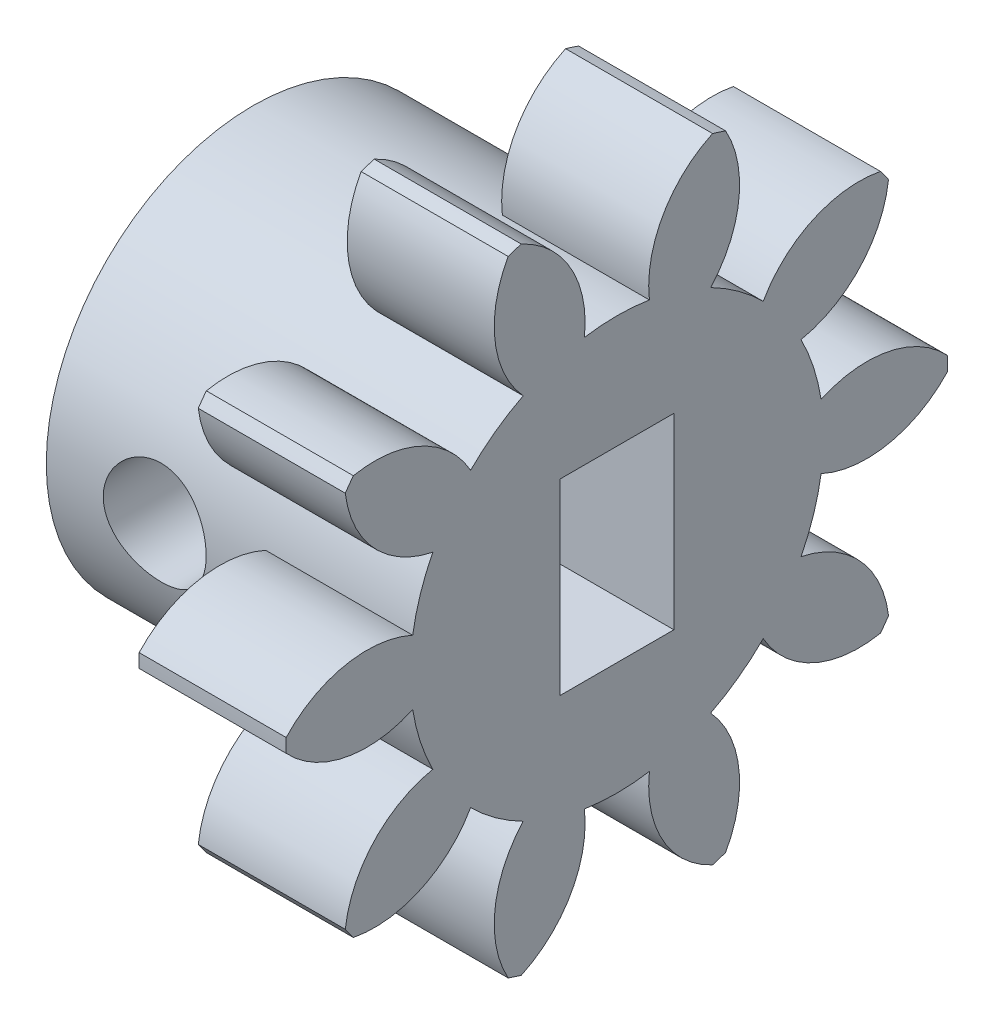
ISO-10303-21;
HEADER;
FILE_DESCRIPTION(('STEP AP214'),'2;1');
FILE_NAME('part.step','',(''),(''),'','','');
FILE_SCHEMA(('AUTOMOTIVE_DESIGN { 1 0 10303 214 1 1 1 1 }'));
ENDSEC;
DATA;
#1=APPLICATION_CONTEXT('core data for automotive mechanical design processes');
#2=APPLICATION_PROTOCOL_DEFINITION('international standard','automotive_design',2000,#1);
#3=PRODUCT_CONTEXT('',#1,'mechanical');
#4=PRODUCT('Part','Part','',(#3));
#5=PRODUCT_RELATED_PRODUCT_CATEGORY('part','',(#4));
#6=PRODUCT_DEFINITION_FORMATION('','',#4);
#7=PRODUCT_DEFINITION_CONTEXT('part definition',#1,'design');
#8=PRODUCT_DEFINITION('design','',#6,#7);
#9=PRODUCT_DEFINITION_SHAPE('','',#8);
#10=(LENGTH_UNIT() NAMED_UNIT(*) SI_UNIT(.MILLI.,.METRE.));
#11=(NAMED_UNIT(*) PLANE_ANGLE_UNIT() SI_UNIT($,.RADIAN.));
#12=(NAMED_UNIT(*) SI_UNIT($,.STERADIAN.) SOLID_ANGLE_UNIT());
#13=UNCERTAINTY_MEASURE_WITH_UNIT(LENGTH_MEASURE(1.E-05),#10,'distance_accuracy_value','');
#14=(GEOMETRIC_REPRESENTATION_CONTEXT(3) GLOBAL_UNCERTAINTY_ASSIGNED_CONTEXT((#13)) GLOBAL_UNIT_ASSIGNED_CONTEXT((#10,
#11,#12)) REPRESENTATION_CONTEXT('',''));
#15=CARTESIAN_POINT('',(0.,0.,0.));
#16=DIRECTION('',(0.,0.,1.));
#17=DIRECTION('',(1.,0.,0.));
#18=AXIS2_PLACEMENT_3D('',#15,#16,#17);
#19=CARTESIAN_POINT('',(-2.95,0.,-9.));
#20=DIRECTION('',(0.,0.,1.));
#21=DIRECTION('',(1.,0.,0.));
#22=AXIS2_PLACEMENT_3D('',#19,#20,#21);
#23=CYLINDRICAL_SURFACE('',#22,1.4);
#24=CARTESIAN_POINT('',(-1.55,0.,-5.624));
#25=CARTESIAN_POINT('',(-1.55000219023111,-0.077361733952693,-5.62399868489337));
#26=CARTESIAN_POINT('',(-1.55643390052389,-0.154748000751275,-5.62238784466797));
#27=CARTESIAN_POINT('',(-1.58195270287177,-0.307303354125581,-5.61611795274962));
#28=CARTESIAN_POINT('',(-1.60104703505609,-0.382471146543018,-5.61145715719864));
#29=CARTESIAN_POINT('',(-1.65124101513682,-0.528364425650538,-5.5996035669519));
#30=CARTESIAN_POINT('',(-1.6823263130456,-0.599095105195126,-5.59241379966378));
#31=CARTESIAN_POINT('',(-1.75556951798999,-0.734337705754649,-5.57626834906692));
#32=CARTESIAN_POINT('',(-1.79772777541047,-0.798849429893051,-5.56731260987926));
#33=CARTESIAN_POINT('',(-1.89283014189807,-0.921141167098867,-5.54840319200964));
#34=CARTESIAN_POINT('',(-1.94595790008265,-0.978776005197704,-5.53843422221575));
#35=CARTESIAN_POINT('',(-2.06109793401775,-1.08441627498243,-5.51872371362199));
#36=CARTESIAN_POINT('',(-2.1231112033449,-1.13242062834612,-5.50898220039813));
#37=CARTESIAN_POINT('',(-2.25538721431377,-1.21811850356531,-5.49067553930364));
#38=CARTESIAN_POINT('',(-2.32575791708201,-1.25564991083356,-5.48212981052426));
#39=CARTESIAN_POINT('',(-2.47205681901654,-1.31829407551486,-5.46740517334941));
#40=CARTESIAN_POINT('',(-2.54798413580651,-1.34340879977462,-5.46122589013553));
#41=CARTESIAN_POINT('',(-2.70164538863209,-1.3800119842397,-5.45209089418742));
#42=CARTESIAN_POINT('',(-2.77931343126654,-1.39176133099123,-5.44907355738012));
#43=CARTESIAN_POINT('',(-2.93557232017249,-1.40211280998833,-5.44641960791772));
#44=CARTESIAN_POINT('',(-3.01416301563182,-1.40071706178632,-5.44678245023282));
#45=CARTESIAN_POINT('',(-3.1680390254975,-1.38502618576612,-5.45079245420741));
#46=CARTESIAN_POINT('',(-3.24335839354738,-1.37104164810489,-5.45436053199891));
#47=CARTESIAN_POINT('',(-3.3905468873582,-1.33106549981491,-5.46425297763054));
#48=CARTESIAN_POINT('',(-3.4624157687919,-1.30507304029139,-5.47057754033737));
#49=CARTESIAN_POINT('',(-3.6014974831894,-1.24155346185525,-5.48534311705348));
#50=CARTESIAN_POINT('',(-3.66865645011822,-1.20391338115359,-5.49380470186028));
#51=CARTESIAN_POINT('',(-3.79581650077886,-1.11824604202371,-5.51187926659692));
#52=CARTESIAN_POINT('',(-3.8558163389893,-1.07021698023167,-5.52149244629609));
#53=CARTESIAN_POINT('',(-3.96873513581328,-0.963524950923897,-5.54112025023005));
#54=CARTESIAN_POINT('',(-4.02140604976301,-0.904599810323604,-5.55113854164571));
#55=CARTESIAN_POINT('',(-4.11616551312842,-0.778633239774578,-5.57020267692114));
#56=CARTESIAN_POINT('',(-4.15825374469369,-0.711591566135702,-5.57924849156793));
#57=CARTESIAN_POINT('',(-4.23074310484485,-0.570942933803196,-5.59539285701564));
#58=CARTESIAN_POINT('',(-4.26110422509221,-0.497314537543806,-5.60248471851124));
#59=CARTESIAN_POINT('',(-4.30894938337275,-0.345783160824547,-5.61387343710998));
#60=CARTESIAN_POINT('',(-4.32643586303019,-0.267880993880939,-5.61817082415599));
#61=CARTESIAN_POINT('',(-4.34765720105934,-0.112134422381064,-5.62340808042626));
#62=CARTESIAN_POINT('',(-4.35172988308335,-0.0343387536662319,-5.62443041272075));
#63=CARTESIAN_POINT('',(-4.34693418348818,0.120822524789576,-5.62323710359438));
#64=CARTESIAN_POINT('',(-4.33806695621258,0.198188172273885,-5.62102175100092));
#65=CARTESIAN_POINT('',(-4.30792167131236,0.349121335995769,-5.61365480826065));
#66=CARTESIAN_POINT('',(-4.28682765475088,0.422727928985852,-5.60854678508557));
#67=CARTESIAN_POINT('',(-4.23303757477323,0.565354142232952,-5.59597006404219));
#68=CARTESIAN_POINT('',(-4.20034034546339,0.634373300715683,-5.58850112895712));
#69=CARTESIAN_POINT('',(-4.12361551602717,0.767211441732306,-5.57183335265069));
#70=CARTESIAN_POINT('',(-4.07939836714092,0.830917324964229,-5.5626063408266));
#71=CARTESIAN_POINT('',(-3.98113140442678,0.950124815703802,-5.54349076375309));
#72=CARTESIAN_POINT('',(-3.9270799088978,1.00562501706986,-5.53360208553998));
#73=CARTESIAN_POINT('',(-3.80911065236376,1.10823583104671,-5.51398127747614));
#74=CARTESIAN_POINT('',(-3.74498490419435,1.15510956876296,-5.50425880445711));
#75=CARTESIAN_POINT('',(-3.60957807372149,1.2374301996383,-5.48633978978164));
#76=CARTESIAN_POINT('',(-3.53829730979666,1.27287760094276,-5.47814318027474));
#77=CARTESIAN_POINT('',(-3.39098698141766,1.33107594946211,-5.46429392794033));
#78=CARTESIAN_POINT('',(-3.31498862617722,1.3539021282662,-5.45862625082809));
#79=CARTESIAN_POINT('',(-3.16007056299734,1.38640933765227,-5.45046157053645));
#80=CARTESIAN_POINT('',(-3.08115149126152,1.39609321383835,-5.44796388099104));
#81=CARTESIAN_POINT('',(-2.92504181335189,1.40189320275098,-5.44647397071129));
#82=CARTESIAN_POINT('',(-2.84786597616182,1.39838779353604,-5.44738396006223));
#83=CARTESIAN_POINT('',(-2.69524292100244,1.37877420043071,-5.45238095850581));
#84=CARTESIAN_POINT('',(-2.61979566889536,1.36266626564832,-5.45646790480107));
#85=CARTESIAN_POINT('',(-2.47317896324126,1.31851075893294,-5.46730405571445));
#86=CARTESIAN_POINT('',(-2.40198706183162,1.290533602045,-5.47403754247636));
#87=CARTESIAN_POINT('',(-2.26525703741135,1.22348964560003,-5.48941041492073));
#88=CARTESIAN_POINT('',(-2.19971969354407,1.18442132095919,-5.49805006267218));
#89=CARTESIAN_POINT('',(-2.07432888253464,1.09511499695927,-5.51654113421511));
#90=CARTESIAN_POINT('',(-2.01466638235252,1.04461412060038,-5.52641812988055));
#91=CARTESIAN_POINT('',(-1.90453942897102,0.934389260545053,-5.54611769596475));
#92=CARTESIAN_POINT('',(-1.85407716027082,0.874663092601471,-5.55594025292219));
#93=CARTESIAN_POINT('',(-1.76290220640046,0.746391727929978,-5.57463414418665));
#94=CARTESIAN_POINT('',(-1.72238036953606,0.677707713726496,-5.58348528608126));
#95=CARTESIAN_POINT('',(-1.65352277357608,0.534288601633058,-5.59902646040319));
#96=CARTESIAN_POINT('',(-1.62517822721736,0.459557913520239,-5.60571805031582));
#97=CARTESIAN_POINT('',(-1.58571820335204,0.320793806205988,-5.61518938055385));
#98=CARTESIAN_POINT('',(-1.57235270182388,0.257424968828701,-5.61847075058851));
#99=CARTESIAN_POINT('',(-1.55449301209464,0.129376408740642,-5.62287653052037));
#100=CARTESIAN_POINT('',(-1.54999816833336,0.0646967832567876,-5.62400109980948));
#101=CARTESIAN_POINT('',(-1.55,0.,-5.624));
#102=B_SPLINE_CURVE_WITH_KNOTS('',3,(#24,#25,#26,#27,#28,#29,#30,#31,#32,#33,#34,#35,#36,#37,
#38,#39,#40,#41,#42,#43,#44,#45,#46,#47,#48,#49,#50,#51,#52,#53,#54,#55,#56,#57,#58,#59,#60,#61,
#62,#63,#64,#65,#66,#67,#68,#69,#70,#71,#72,#73,#74,#75,#76,#77,#78,#79,#80,#81,#82,#83,#84,#85,
#86,#87,#88,#89,#90,#91,#92,#93,#94,#95,#96,#97,#98,#99,#100,#101),.UNSPECIFIED.,.T.,.F.,(4,2,2,
2,2,2,2,2,2,2,2,2,2,2,2,2,2,2,2,2,2,2,2,2,2,2,2,2,2,2,2,2,2,2,2,2,2,2,4),(0.,0.23184812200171,
0.463828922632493,0.695532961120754,0.927244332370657,1.16320571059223,1.39919349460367,
1.63865376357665,1.8780760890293,2.11274017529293,2.34736642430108,2.57635800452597,
2.80536577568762,3.036668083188,3.26801057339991,3.50589127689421,3.74377912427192,
3.98247153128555,4.22111865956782,4.453707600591,4.68627579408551,4.91543100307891,
5.14460924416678,5.37782693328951,5.61108454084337,5.85001526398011,6.08893536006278,
6.32641552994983,6.56384427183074,6.79451245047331,7.02517606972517,7.25448998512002,
7.48383544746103,7.71911568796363,7.95445172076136,8.19400357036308,8.4333822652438,
8.62728867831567,8.82118076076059),.UNSPECIFIED.);
#103=CARTESIAN_POINT('',(-1.55,0.,-5.624));
#104=VERTEX_POINT('',#103);
#105=EDGE_CURVE('E634',#104,#104,#102,.T.);
#106=ORIENTED_EDGE('',*,*,#105,.T.);
#107=EDGE_LOOP('',(#106));
#108=FACE_BOUND('',#107,.T.);
#109=DIRECTION('',(0.,0.,1.));
#110=VECTOR('',#109,1.);
#111=CARTESIAN_POINT('',(-3.9,-1.02834819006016,-9.));
#112=LINE('',#111,#110);
#113=CARTESIAN_POINT('',(-3.9,-1.02834819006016,-1.55));
#114=VERTEX_POINT('',#113);
#115=CARTESIAN_POINT('',(-3.9,-1.02834819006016,-2.33345237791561));
#116=VERTEX_POINT('',#115);
#117=EDGE_CURVE('E736',#114,#116,#112,.F.);
#118=ORIENTED_EDGE('',*,*,#117,.F.);
#119=CARTESIAN_POINT('',(-2.95,0.,-1.55));
#120=DIRECTION('',(0.,0.,-1.));
#121=DIRECTION('',(0.,1.,0.));
#122=AXIS2_PLACEMENT_3D('',#119,#120,#121);
#123=CIRCLE('',#122,1.4);
#124=CARTESIAN_POINT('',(-3.9,1.02834819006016,-1.55));
#125=VERTEX_POINT('',#124);
#126=EDGE_CURVE('E40',#114,#125,#123,.F.);
#127=ORIENTED_EDGE('',*,*,#126,.T.);
#128=DIRECTION('',(0.,0.,1.));
#129=VECTOR('',#128,1.);
#130=CARTESIAN_POINT('',(-3.9,1.02834819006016,-9.));
#131=LINE('',#130,#129);
#132=CARTESIAN_POINT('',(-3.9,1.02834819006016,-2.33345237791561));
#133=VERTEX_POINT('',#132);
#134=EDGE_CURVE('E53',#133,#125,#131,.T.);
#135=ORIENTED_EDGE('',*,*,#134,.F.);
#136=CARTESIAN_POINT('',(-3.9,1.02834819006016,-2.33345237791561));
#137=CARTESIAN_POINT('',(-3.92836283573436,1.0021405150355,-2.34500223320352));
#138=CARTESIAN_POINT('',(-3.95563745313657,0.974773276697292,-2.35653485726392));
#139=CARTESIAN_POINT('',(-4.00789742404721,0.917797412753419,-2.37930468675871));
#140=CARTESIAN_POINT('',(-4.03288178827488,0.888187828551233,-2.39054176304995));
#141=CARTESIAN_POINT('',(-4.10439500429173,0.795889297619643,-2.42349508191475));
#142=CARTESIAN_POINT('',(-4.14724286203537,0.729952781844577,-2.44435161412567));
#143=CARTESIAN_POINT('',(-4.22178455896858,0.590616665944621,-2.48171135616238));
#144=CARTESIAN_POINT('',(-4.25344166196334,0.517193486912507,-2.49820018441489));
#145=CARTESIAN_POINT('',(-4.30390911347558,0.365125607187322,-2.52489778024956));
#146=CARTESIAN_POINT('',(-4.32275331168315,0.286495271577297,-2.53512308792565));
#147=CARTESIAN_POINT('',(-4.34557467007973,0.133514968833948,-2.54755717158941));
#148=CARTESIAN_POINT('',(-4.35070052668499,0.0593860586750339,-2.55038485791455));
#149=CARTESIAN_POINT('',(-4.34914568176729,-0.0887324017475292,-2.5495307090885));
#150=CARTESIAN_POINT('',(-4.34246313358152,-0.16272192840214,-2.54584785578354));
#151=CARTESIAN_POINT('',(-4.31846421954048,-0.303434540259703,-2.53280539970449));
#152=CARTESIAN_POINT('',(-4.30186303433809,-0.370318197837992,-2.52382807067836));
#153=CARTESIAN_POINT('',(-4.25935759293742,-0.500259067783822,-2.50131821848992));
#154=CARTESIAN_POINT('',(-4.23344889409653,-0.56331443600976,-2.48778352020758));
#155=CARTESIAN_POINT('',(-4.17143137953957,-0.687921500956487,-2.4563466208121));
#156=CARTESIAN_POINT('',(-4.13480872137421,-0.749162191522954,-2.43823298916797));
#157=CARTESIAN_POINT('',(-4.05320462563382,-0.864837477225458,-2.39963896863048));
#158=CARTESIAN_POINT('',(-4.00823327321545,-0.919280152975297,-2.37916144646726));
#159=CARTESIAN_POINT('',(-3.94027760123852,-0.990013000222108,-2.35007475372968));
#160=CARTESIAN_POINT('',(-3.92041398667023,-1.00949033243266,-2.34176547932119));
#161=CARTESIAN_POINT('',(-3.90000000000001,-1.02834819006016,-2.33345237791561));
#162=B_SPLINE_CURVE_WITH_KNOTS('',3,(#136,#137,#138,#139,#140,#141,#142,#143,#144,#145,#146,
#147,#148,#149,#150,#151,#152,#153,#154,#155,#156,#157,#158,#159,#160,#161),.UNSPECIFIED.,.F.,
.F.,(4,2,2,2,2,2,2,2,2,2,2,2,4),(0.,0.120855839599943,0.241763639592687,0.48459734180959,
0.72822095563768,0.971198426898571,1.19308096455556,1.41499820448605,1.62257286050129,
1.83024672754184,2.05023807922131,2.26996539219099,2.35701408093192),.UNSPECIFIED.);
#163=EDGE_CURVE('E671',#133,#116,#162,.T.);
#164=ORIENTED_EDGE('',*,*,#163,.T.);
#165=EDGE_LOOP('',(#118,#127,#135,#164));
#166=FACE_BOUND('',#165,.T.);
#167=ADVANCED_FACE('F36',(#108,#166),#23,.F.);
#168=CARTESIAN_POINT('',(-1.55,0.,5.624));
#169=CARTESIAN_POINT('',(-1.55000219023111,0.077361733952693,5.62399868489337));
#170=CARTESIAN_POINT('',(-1.55643390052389,0.154748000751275,5.62238784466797));
#171=CARTESIAN_POINT('',(-1.58195270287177,0.307303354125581,5.61611795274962));
#172=CARTESIAN_POINT('',(-1.60104703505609,0.382471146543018,5.61145715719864));
#173=CARTESIAN_POINT('',(-1.65124101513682,0.528364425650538,5.5996035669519));
#174=CARTESIAN_POINT('',(-1.6823263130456,0.599095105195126,5.59241379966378));
#175=CARTESIAN_POINT('',(-1.75556951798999,0.734337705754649,5.57626834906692));
#176=CARTESIAN_POINT('',(-1.79772777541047,0.798849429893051,5.56731260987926));
#177=CARTESIAN_POINT('',(-1.89283014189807,0.921141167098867,5.54840319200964));
#178=CARTESIAN_POINT('',(-1.94595790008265,0.978776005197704,5.53843422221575));
#179=CARTESIAN_POINT('',(-2.06109793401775,1.08441627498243,5.51872371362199));
#180=CARTESIAN_POINT('',(-2.1231112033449,1.13242062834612,5.50898220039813));
#181=CARTESIAN_POINT('',(-2.25538721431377,1.21811850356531,5.49067553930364));
#182=CARTESIAN_POINT('',(-2.32575791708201,1.25564991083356,5.48212981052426));
#183=CARTESIAN_POINT('',(-2.47205681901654,1.31829407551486,5.46740517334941));
#184=CARTESIAN_POINT('',(-2.54798413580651,1.34340879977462,5.46122589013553));
#185=CARTESIAN_POINT('',(-2.70164538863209,1.3800119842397,5.45209089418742));
#186=CARTESIAN_POINT('',(-2.77931343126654,1.39176133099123,5.44907355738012));
#187=CARTESIAN_POINT('',(-2.93557232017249,1.40211280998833,5.44641960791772));
#188=CARTESIAN_POINT('',(-3.01416301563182,1.40071706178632,5.44678245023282));
#189=CARTESIAN_POINT('',(-3.1680390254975,1.38502618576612,5.45079245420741));
#190=CARTESIAN_POINT('',(-3.24335839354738,1.37104164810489,5.45436053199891));
#191=CARTESIAN_POINT('',(-3.3905468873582,1.33106549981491,5.46425297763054));
#192=CARTESIAN_POINT('',(-3.4624157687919,1.30507304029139,5.47057754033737));
#193=CARTESIAN_POINT('',(-3.6014974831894,1.24155346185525,5.48534311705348));
#194=CARTESIAN_POINT('',(-3.66865645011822,1.20391338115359,5.49380470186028));
#195=CARTESIAN_POINT('',(-3.79581650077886,1.11824604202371,5.51187926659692));
#196=CARTESIAN_POINT('',(-3.8558163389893,1.07021698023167,5.52149244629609));
#197=CARTESIAN_POINT('',(-3.96873513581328,0.963524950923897,5.54112025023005));
#198=CARTESIAN_POINT('',(-4.02140604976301,0.904599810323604,5.55113854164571));
#199=CARTESIAN_POINT('',(-4.11616551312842,0.778633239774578,5.57020267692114));
#200=CARTESIAN_POINT('',(-4.15825374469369,0.711591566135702,5.57924849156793));
#201=CARTESIAN_POINT('',(-4.23074310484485,0.570942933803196,5.59539285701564));
#202=CARTESIAN_POINT('',(-4.26110422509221,0.497314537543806,5.60248471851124));
#203=CARTESIAN_POINT('',(-4.30894938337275,0.345783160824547,5.61387343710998));
#204=CARTESIAN_POINT('',(-4.32643586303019,0.267880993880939,5.61817082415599));
#205=CARTESIAN_POINT('',(-4.34765720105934,0.112134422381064,5.62340808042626));
#206=CARTESIAN_POINT('',(-4.35172988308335,0.0343387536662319,5.62443041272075));
#207=CARTESIAN_POINT('',(-4.34693418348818,-0.120822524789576,5.62323710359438));
#208=CARTESIAN_POINT('',(-4.33806695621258,-0.198188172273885,5.62102175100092));
#209=CARTESIAN_POINT('',(-4.30792167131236,-0.349121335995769,5.61365480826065));
#210=CARTESIAN_POINT('',(-4.28682765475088,-0.422727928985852,5.60854678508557));
#211=CARTESIAN_POINT('',(-4.23303757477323,-0.565354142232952,5.59597006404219));
#212=CARTESIAN_POINT('',(-4.20034034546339,-0.634373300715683,5.58850112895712));
#213=CARTESIAN_POINT('',(-4.12361551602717,-0.767211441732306,5.57183335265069));
#214=CARTESIAN_POINT('',(-4.07939836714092,-0.830917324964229,5.5626063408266));
#215=CARTESIAN_POINT('',(-3.98113140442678,-0.950124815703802,5.54349076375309));
#216=CARTESIAN_POINT('',(-3.9270799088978,-1.00562501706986,5.53360208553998));
#217=CARTESIAN_POINT('',(-3.80911065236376,-1.10823583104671,5.51398127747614));
#218=CARTESIAN_POINT('',(-3.74498490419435,-1.15510956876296,5.50425880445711));
#219=CARTESIAN_POINT('',(-3.60957807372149,-1.2374301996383,5.48633978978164));
#220=CARTESIAN_POINT('',(-3.53829730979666,-1.27287760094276,5.47814318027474));
#221=CARTESIAN_POINT('',(-3.39098698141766,-1.33107594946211,5.46429392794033));
#222=CARTESIAN_POINT('',(-3.31498862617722,-1.3539021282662,5.45862625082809));
#223=CARTESIAN_POINT('',(-3.16007056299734,-1.38640933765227,5.45046157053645));
#224=CARTESIAN_POINT('',(-3.08115149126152,-1.39609321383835,5.44796388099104));
#225=CARTESIAN_POINT('',(-2.92504181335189,-1.40189320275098,5.44647397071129));
#226=CARTESIAN_POINT('',(-2.84786597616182,-1.39838779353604,5.44738396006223));
#227=CARTESIAN_POINT('',(-2.69524292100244,-1.37877420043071,5.45238095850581));
#228=CARTESIAN_POINT('',(-2.61979566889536,-1.36266626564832,5.45646790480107));
#229=CARTESIAN_POINT('',(-2.47317896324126,-1.31851075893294,5.46730405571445));
#230=CARTESIAN_POINT('',(-2.40198706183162,-1.290533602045,5.47403754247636));
#231=CARTESIAN_POINT('',(-2.26525703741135,-1.22348964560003,5.48941041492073));
#232=CARTESIAN_POINT('',(-2.19971969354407,-1.18442132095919,5.49805006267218));
#233=CARTESIAN_POINT('',(-2.07432888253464,-1.09511499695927,5.51654113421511));
#234=CARTESIAN_POINT('',(-2.01466638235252,-1.04461412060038,5.52641812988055));
#235=CARTESIAN_POINT('',(-1.90453942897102,-0.934389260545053,5.54611769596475));
#236=CARTESIAN_POINT('',(-1.85407716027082,-0.874663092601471,5.55594025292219));
#237=CARTESIAN_POINT('',(-1.76290220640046,-0.746391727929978,5.57463414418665));
#238=CARTESIAN_POINT('',(-1.72238036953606,-0.677707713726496,5.58348528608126));
#239=CARTESIAN_POINT('',(-1.65352277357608,-0.534288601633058,5.59902646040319));
#240=CARTESIAN_POINT('',(-1.62517822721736,-0.459557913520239,5.60571805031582));
#241=CARTESIAN_POINT('',(-1.58571820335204,-0.320793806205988,5.61518938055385));
#242=CARTESIAN_POINT('',(-1.57235270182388,-0.257424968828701,5.61847075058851));
#243=CARTESIAN_POINT('',(-1.55449301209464,-0.129376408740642,5.62287653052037));
#244=CARTESIAN_POINT('',(-1.54999816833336,-0.0646967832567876,5.62400109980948));
#245=CARTESIAN_POINT('',(-1.55,0.,5.624));
#246=B_SPLINE_CURVE_WITH_KNOTS('',3,(#168,#169,#170,#171,#172,#173,#174,#175,#176,#177,#178,
#179,#180,#181,#182,#183,#184,#185,#186,#187,#188,#189,#190,#191,#192,#193,#194,#195,#196,#197,
#198,#199,#200,#201,#202,#203,#204,#205,#206,#207,#208,#209,#210,#211,#212,#213,#214,#215,#216,
#217,#218,#219,#220,#221,#222,#223,#224,#225,#226,#227,#228,#229,#230,#231,#232,#233,#234,#235,
#236,#237,#238,#239,#240,#241,#242,#243,#244,#245),.UNSPECIFIED.,.T.,.F.,(4,2,2,2,2,2,2,2,2,2,2,
2,2,2,2,2,2,2,2,2,2,2,2,2,2,2,2,2,2,2,2,2,2,2,2,2,2,2,4),(0.,0.23184812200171,0.463828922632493,
0.695532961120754,0.927244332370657,1.16320571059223,1.39919349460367,1.63865376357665,
1.8780760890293,2.11274017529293,2.34736642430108,2.57635800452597,2.80536577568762,
3.036668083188,3.26801057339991,3.50589127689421,3.74377912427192,3.98247153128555,
4.22111865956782,4.453707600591,4.68627579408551,4.91543100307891,5.14460924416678,
5.37782693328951,5.61108454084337,5.85001526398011,6.08893536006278,6.32641552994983,
6.56384427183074,6.79451245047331,7.02517606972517,7.25448998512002,7.48383544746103,
7.71911568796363,7.95445172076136,8.19400357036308,8.4333822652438,8.62728867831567,
8.82118076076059),.UNSPECIFIED.);
#247=CARTESIAN_POINT('',(-1.55,0.,5.624));
#248=VERTEX_POINT('',#247);
#249=EDGE_CURVE('E422',#248,#248,#246,.T.);
#250=ORIENTED_EDGE('',*,*,#249,.T.);
#251=EDGE_LOOP('',(#250));
#252=FACE_BOUND('',#251,.T.);
#253=DIRECTION('',(0.,0.,1.));
#254=VECTOR('',#253,1.);
#255=CARTESIAN_POINT('',(-3.9,-1.02834819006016,-9.));
#256=LINE('',#255,#254);
#257=CARTESIAN_POINT('',(-3.9,-1.02834819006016,2.33345237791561));
#258=VERTEX_POINT('',#257);
#259=CARTESIAN_POINT('',(-3.9,-1.02834819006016,1.55));
#260=VERTEX_POINT('',#259);
#261=EDGE_CURVE('E61',#258,#260,#256,.F.);
#262=ORIENTED_EDGE('',*,*,#261,.F.);
#263=CARTESIAN_POINT('',(-3.9,-1.02834819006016,2.33345237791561));
#264=CARTESIAN_POINT('',(-3.92836283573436,-1.0021405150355,2.34500223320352));
#265=CARTESIAN_POINT('',(-3.95563745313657,-0.974773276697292,2.35653485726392));
#266=CARTESIAN_POINT('',(-4.00789742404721,-0.917797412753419,2.37930468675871));
#267=CARTESIAN_POINT('',(-4.03288178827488,-0.888187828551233,2.39054176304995));
#268=CARTESIAN_POINT('',(-4.10439500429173,-0.795889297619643,2.42349508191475));
#269=CARTESIAN_POINT('',(-4.14724286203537,-0.729952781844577,2.44435161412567));
#270=CARTESIAN_POINT('',(-4.22178455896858,-0.590616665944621,2.48171135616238));
#271=CARTESIAN_POINT('',(-4.25344166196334,-0.517193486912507,2.49820018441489));
#272=CARTESIAN_POINT('',(-4.30390911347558,-0.365125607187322,2.52489778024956));
#273=CARTESIAN_POINT('',(-4.32275331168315,-0.286495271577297,2.53512308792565));
#274=CARTESIAN_POINT('',(-4.34557467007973,-0.133514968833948,2.54755717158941));
#275=CARTESIAN_POINT('',(-4.35070052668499,-0.0593860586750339,2.55038485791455));
#276=CARTESIAN_POINT('',(-4.34914568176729,0.0887324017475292,2.5495307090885));
#277=CARTESIAN_POINT('',(-4.34246313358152,0.16272192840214,2.54584785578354));
#278=CARTESIAN_POINT('',(-4.31846421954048,0.303434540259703,2.53280539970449));
#279=CARTESIAN_POINT('',(-4.30186303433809,0.370318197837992,2.52382807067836));
#280=CARTESIAN_POINT('',(-4.25935759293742,0.500259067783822,2.50131821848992));
#281=CARTESIAN_POINT('',(-4.23344889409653,0.56331443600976,2.48778352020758));
#282=CARTESIAN_POINT('',(-4.17143137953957,0.687921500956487,2.4563466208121));
#283=CARTESIAN_POINT('',(-4.13480872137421,0.749162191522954,2.43823298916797));
#284=CARTESIAN_POINT('',(-4.05320462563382,0.864837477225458,2.39963896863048));
#285=CARTESIAN_POINT('',(-4.00823327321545,0.919280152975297,2.37916144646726));
#286=CARTESIAN_POINT('',(-3.94027760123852,0.990013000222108,2.35007475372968));
#287=CARTESIAN_POINT('',(-3.92041398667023,1.00949033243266,2.34176547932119));
#288=CARTESIAN_POINT('',(-3.90000000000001,1.02834819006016,2.33345237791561));
#289=B_SPLINE_CURVE_WITH_KNOTS('',3,(#263,#264,#265,#266,#267,#268,#269,#270,#271,#272,#273,
#274,#275,#276,#277,#278,#279,#280,#281,#282,#283,#284,#285,#286,#287,#288),.UNSPECIFIED.,.F.,
.F.,(4,2,2,2,2,2,2,2,2,2,2,2,4),(0.,0.120855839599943,0.241763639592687,0.48459734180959,
0.72822095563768,0.971198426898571,1.19308096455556,1.41499820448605,1.62257286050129,
1.83024672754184,2.05023807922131,2.26996539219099,2.35701408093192),.UNSPECIFIED.);
#290=CARTESIAN_POINT('',(-3.9,1.02834819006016,2.33345237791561));
#291=VERTEX_POINT('',#290);
#292=EDGE_CURVE('E663',#258,#291,#289,.T.);
#293=ORIENTED_EDGE('',*,*,#292,.T.);
#294=DIRECTION('',(0.,0.,1.));
#295=VECTOR('',#294,1.);
#296=CARTESIAN_POINT('',(-3.9,1.02834819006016,-9.));
#297=LINE('',#296,#295);
#298=CARTESIAN_POINT('',(-3.9,1.02834819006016,1.55));
#299=VERTEX_POINT('',#298);
#300=EDGE_CURVE('E741',#299,#291,#297,.T.);
#301=ORIENTED_EDGE('',*,*,#300,.F.);
#302=CARTESIAN_POINT('',(-2.95,0.,1.55));
#303=DIRECTION('',(0.,0.,1.));
#304=DIRECTION('',(0.,-1.,0.));
#305=AXIS2_PLACEMENT_3D('',#302,#303,#304);
#306=CIRCLE('',#305,1.4);
#307=EDGE_CURVE('E406',#299,#260,#306,.F.);
#308=ORIENTED_EDGE('',*,*,#307,.T.);
#309=EDGE_LOOP('',(#262,#293,#301,#308));
#310=FACE_BOUND('',#309,.T.);
#311=ADVANCED_FACE('F653',(#252,#310),#23,.F.);
#312=CARTESIAN_POINT('',(0.,0.,0.));
#313=DIRECTION('',(1.,0.,0.));
#314=DIRECTION('',(0.,0.,-1.));
#315=AXIS2_PLACEMENT_3D('',#312,#313,#314);
#316=PLANE('',#315);
#317=CARTESIAN_POINT('',(0.,0.,0.));
#318=DIRECTION('',(-1.,0.,0.));
#319=DIRECTION('',(0.,0.,1.));
#320=AXIS2_PLACEMENT_3D('',#317,#318,#319);
#321=CIRCLE('',#320,5.624);
#322=CARTESIAN_POINT('',(0.,-2.55693256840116,-5.00913883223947));
#323=VERTEX_POINT('',#322);
#324=CARTESIAN_POINT('',(0.,-3.97383851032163,-3.97969640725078));
#325=VERTEX_POINT('',#324);
#326=EDGE_CURVE('E1391',#323,#325,#321,.T.);
#327=ORIENTED_EDGE('',*,*,#326,.F.);
#328=CARTESIAN_POINT('',(0.,-5.49668801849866,-4.41094330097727));
#329=DIRECTION('',(-1.,0.,0.));
#330=DIRECTION('',(0.,-0.951056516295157,0.309016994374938));
#331=AXIS2_PLACEMENT_3D('',#328,#329,#330);
#332=CIRCLE('',#331,3.);
#333=CARTESIAN_POINT('',(0.,-5.13778266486,-7.38939708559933));
#334=VERTEX_POINT('',#333);
#335=EDGE_CURVE('E426',#323,#334,#332,.T.);
#336=ORIENTED_EDGE('',*,*,#335,.T.);
#337=CARTESIAN_POINT('',(0.,0.,0.));
#338=DIRECTION('',(-1.,0.,0.));
#339=DIRECTION('',(0.,0.,1.));
#340=AXIS2_PLACEMENT_3D('',#337,#338,#339);
#341=CIRCLE('',#340,8.99999999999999);
#342=CARTESIAN_POINT('',(0.,-5.44007209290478,-7.16977096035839));
#343=VERTEX_POINT('',#342);
#344=EDGE_CURVE('E1321',#334,#343,#341,.T.);
#345=ORIENTED_EDGE('',*,*,#344,.T.);
#346=CARTESIAN_POINT('',(0.,-2.49648635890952,-6.59071739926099));
#347=DIRECTION('',(1.,0.,0.));
#348=DIRECTION('',(0.,0.,-1.));
#349=AXIS2_PLACEMENT_3D('',#346,#347,#348);
#350=CIRCLE('',#349,3.);
#351=EDGE_CURVE('E631',#325,#343,#350,.T.);
#352=ORIENTED_EDGE('',*,*,#351,.F.);
#353=EDGE_LOOP('',(#327,#336,#345,#352));
#354=FACE_BOUND('',#353,.T.);
#355=ADVANCED_FACE('F839',(#354),#316,.F.);
#356=CARTESIAN_POINT('',(0.,-5.01289983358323,-2.54955118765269));
#357=VERTEX_POINT('',#356);
#358=CARTESIAN_POINT('',(0.,-5.55410974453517,-0.883878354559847));
#359=VERTEX_POINT('',#358);
#360=EDGE_CURVE('E1353',#357,#359,#321,.T.);
#361=ORIENTED_EDGE('',*,*,#360,.F.);
#362=CARTESIAN_POINT('',(0.,-7.03960144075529,-0.337655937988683));
#363=DIRECTION('',(-1.,0.,0.));
#364=DIRECTION('',(0.,-0.58778525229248,0.809016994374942));
#365=AXIS2_PLACEMENT_3D('',#362,#363,#364);
#366=CIRCLE('',#365,3.);
#367=CARTESIAN_POINT('',(0.,-8.49993211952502,-2.95823494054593));
#368=VERTEX_POINT('',#367);
#369=EDGE_CURVE('E438',#357,#368,#366,.T.);
#370=ORIENTED_EDGE('',*,*,#369,.T.);
#371=CARTESIAN_POINT('',(0.,-8.61539640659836,-2.60287240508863));
#372=VERTEX_POINT('',#371);
#373=EDGE_CURVE('E1334',#368,#372,#341,.T.);
#374=ORIENTED_EDGE('',*,*,#373,.T.);
#375=CARTESIAN_POINT('',(0.,-5.89362637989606,-3.86460451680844));
#376=DIRECTION('',(1.,0.,0.));
#377=DIRECTION('',(0.,0.,-1.));
#378=AXIS2_PLACEMENT_3D('',#375,#376,#377);
#379=CIRCLE('',#378,3.);
#380=EDGE_CURVE('E623',#359,#372,#379,.T.);
#381=ORIENTED_EDGE('',*,*,#380,.F.);
#382=EDGE_LOOP('',(#361,#370,#374,#381));
#383=FACE_BOUND('',#382,.T.);
#384=ADVANCED_FACE('F1132',(#383),#316,.F.);
#385=CARTESIAN_POINT('',(0.,-5.55410974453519,0.883878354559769));
#386=VERTEX_POINT('',#385);
#387=CARTESIAN_POINT('',(0.,-5.01289983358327,2.54955118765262));
#388=VERTEX_POINT('',#387);
#389=EDGE_CURVE('E1361',#386,#388,#321,.T.);
#390=ORIENTED_EDGE('',*,*,#389,.F.);
#391=CARTESIAN_POINT('',(0.,-5.89362637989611,3.86460451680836));
#392=DIRECTION('',(-1.,0.,0.));
#393=DIRECTION('',(0.,0.,1.));
#394=AXIS2_PLACEMENT_3D('',#391,#392,#393);
#395=CIRCLE('',#394,3.);
#396=CARTESIAN_POINT('',(0.,-8.6153964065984,2.60287240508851));
#397=VERTEX_POINT('',#396);
#398=EDGE_CURVE('E452',#386,#397,#395,.T.);
#399=ORIENTED_EDGE('',*,*,#398,.T.);
#400=CARTESIAN_POINT('',(0.,-8.49993211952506,2.95823494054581));
#401=VERTEX_POINT('',#400);
#402=EDGE_CURVE('E1330',#397,#401,#341,.T.);
#403=ORIENTED_EDGE('',*,*,#402,.T.);
#404=CARTESIAN_POINT('',(0.,-7.03960144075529,0.337655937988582));
#405=DIRECTION('',(1.,0.,0.));
#406=DIRECTION('',(0.,0.,-1.));
#407=AXIS2_PLACEMENT_3D('',#404,#405,#406);
#408=CIRCLE('',#407,3.);
#409=EDGE_CURVE('E621',#388,#401,#408,.T.);
#410=ORIENTED_EDGE('',*,*,#409,.F.);
#411=EDGE_LOOP('',(#390,#399,#403,#410));
#412=FACE_BOUND('',#411,.T.);
#413=ADVANCED_FACE('F1123',(#412),#316,.F.);
#414=CARTESIAN_POINT('',(0.,-3.97383851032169,3.97969640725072));
#415=VERTEX_POINT('',#414);
#416=CARTESIAN_POINT('',(0.,-2.55693256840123,5.00913883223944));
#417=VERTEX_POINT('',#416);
#418=EDGE_CURVE('E421',#415,#417,#321,.T.);
#419=ORIENTED_EDGE('',*,*,#418,.F.);
#420=CARTESIAN_POINT('',(0.,-2.49648635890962,6.59071739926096));
#421=DIRECTION('',(-1.,0.,0.));
#422=DIRECTION('',(0.,0.587785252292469,0.809016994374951));
#423=AXIS2_PLACEMENT_3D('',#420,#421,#422);
#424=CIRCLE('',#423,3.);
#425=CARTESIAN_POINT('',(0.,-5.44007209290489,7.16977096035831));
#426=VERTEX_POINT('',#425);
#427=EDGE_CURVE('E491',#415,#426,#424,.T.);
#428=ORIENTED_EDGE('',*,*,#427,.T.);
#429=CARTESIAN_POINT('',(0.,-5.13778266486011,7.38939708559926));
#430=VERTEX_POINT('',#429);
#431=EDGE_CURVE('E1326',#426,#430,#341,.T.);
#432=ORIENTED_EDGE('',*,*,#431,.T.);
#433=CARTESIAN_POINT('',(0.,-5.49668801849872,4.41094330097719));
#434=DIRECTION('',(1.,0.,0.));
#435=DIRECTION('',(0.,0.,-1.));
#436=AXIS2_PLACEMENT_3D('',#433,#434,#435);
#437=CIRCLE('',#436,3.);
#438=EDGE_CURVE('E625',#417,#430,#437,.T.);
#439=ORIENTED_EDGE('',*,*,#438,.F.);
#440=EDGE_LOOP('',(#419,#428,#432,#439));
#441=FACE_BOUND('',#440,.T.);
#442=ADVANCED_FACE('F1114',(#441),#316,.F.);
#443=CARTESIAN_POINT('',(0.,-0.875696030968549,5.55540569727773));
#444=VERTEX_POINT('',#443);
#445=CARTESIAN_POINT('',(0.,0.875696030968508,5.55540569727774));
#446=VERTEX_POINT('',#445);
#447=EDGE_CURVE('E418',#444,#446,#321,.T.);
#448=ORIENTED_EDGE('',*,*,#447,.F.);
#449=CARTESIAN_POINT('',(0.,1.85422659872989,6.79940024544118));
#450=DIRECTION('',(-1.,0.,0.));
#451=DIRECTION('',(0.,0.951056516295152,0.309016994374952));
#452=AXIS2_PLACEMENT_3D('',#449,#450,#451);
#453=CIRCLE('',#452,3.);
#454=CARTESIAN_POINT('',(0.,-0.186825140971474,8.9980607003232));
#455=VERTEX_POINT('',#454);
#456=EDGE_CURVE('E505',#444,#455,#453,.T.);
#457=ORIENTED_EDGE('',*,*,#456,.T.);
#458=CARTESIAN_POINT('',(0.,0.18682514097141,8.9980607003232));
#459=VERTEX_POINT('',#458);
#460=EDGE_CURVE('E1322',#455,#459,#341,.T.);
#461=ORIENTED_EDGE('',*,*,#460,.T.);
#462=CARTESIAN_POINT('',(0.,-1.85422659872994,6.79940024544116));
#463=DIRECTION('',(1.,0.,0.));
#464=DIRECTION('',(0.,0.,-1.));
#465=AXIS2_PLACEMENT_3D('',#462,#463,#464);
#466=CIRCLE('',#465,3.);
#467=EDGE_CURVE('E627',#446,#459,#466,.T.);
#468=ORIENTED_EDGE('',*,*,#467,.F.);
#469=EDGE_LOOP('',(#448,#457,#461,#468));
#470=FACE_BOUND('',#469,.T.);
#471=ADVANCED_FACE('F1105',(#470),#316,.F.);
#472=CARTESIAN_POINT('',(0.,2.5569325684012,5.00913883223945));
#473=VERTEX_POINT('',#472);
#474=CARTESIAN_POINT('',(0.,3.97383851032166,3.97969640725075));
#475=VERTEX_POINT('',#474);
#476=EDGE_CURVE('E417',#473,#475,#321,.T.);
#477=ORIENTED_EDGE('',*,*,#476,.F.);
#478=CARTESIAN_POINT('',(0.,5.49668801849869,4.41094330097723));
#479=DIRECTION('',(-1.,0.,0.));
#480=DIRECTION('',(0.,0.951056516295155,-0.309016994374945));
#481=AXIS2_PLACEMENT_3D('',#478,#479,#480);
#482=CIRCLE('',#481,3.);
#483=CARTESIAN_POINT('',(0.,5.13778266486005,7.3893970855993));
#484=VERTEX_POINT('',#483);
#485=EDGE_CURVE('E509',#473,#484,#482,.T.);
#486=ORIENTED_EDGE('',*,*,#485,.T.);
#487=CARTESIAN_POINT('',(0.,5.44007209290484,7.16977096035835));
#488=VERTEX_POINT('',#487);
#489=EDGE_CURVE('E609',#484,#488,#341,.T.);
#490=ORIENTED_EDGE('',*,*,#489,.T.);
#491=CARTESIAN_POINT('',(0.,2.49648635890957,6.59071739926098));
#492=DIRECTION('',(1.,0.,0.));
#493=DIRECTION('',(0.,0.,-1.));
#494=AXIS2_PLACEMENT_3D('',#491,#492,#493);
#495=CIRCLE('',#494,3.);
#496=EDGE_CURVE('E618',#475,#488,#495,.T.);
#497=ORIENTED_EDGE('',*,*,#496,.F.);
#498=EDGE_LOOP('',(#477,#486,#490,#497));
#499=FACE_BOUND('',#498,.T.);
#500=ADVANCED_FACE('F1096',(#499),#316,.F.);
#501=CARTESIAN_POINT('',(0.,5.01289983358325,2.54955118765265));
#502=VERTEX_POINT('',#501);
#503=CARTESIAN_POINT('',(0.,5.55410974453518,0.883878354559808));
#504=VERTEX_POINT('',#503);
#505=EDGE_CURVE('E1387',#502,#504,#321,.T.);
#506=ORIENTED_EDGE('',*,*,#505,.F.);
#507=CARTESIAN_POINT('',(0.,7.03960144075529,0.337655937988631));
#508=DIRECTION('',(-1.,0.,0.));
#509=DIRECTION('',(0.,0.587785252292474,-0.809016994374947));
#510=AXIS2_PLACEMENT_3D('',#507,#508,#509);
#511=CIRCLE('',#510,3.);
#512=CARTESIAN_POINT('',(0.,8.49993211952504,2.95823494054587));
#513=VERTEX_POINT('',#512);
#514=EDGE_CURVE('E565',#502,#513,#511,.T.);
#515=ORIENTED_EDGE('',*,*,#514,.T.);
#516=CARTESIAN_POINT('',(0.,8.61539640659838,2.60287240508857));
#517=VERTEX_POINT('',#516);
#518=EDGE_CURVE('E603',#513,#517,#341,.T.);
#519=ORIENTED_EDGE('',*,*,#518,.T.);
#520=CARTESIAN_POINT('',(0.,5.89362637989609,3.8646045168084));
#521=DIRECTION('',(1.,0.,0.));
#522=DIRECTION('',(0.,0.,-1.));
#523=AXIS2_PLACEMENT_3D('',#520,#521,#522);
#524=CIRCLE('',#523,3.);
#525=EDGE_CURVE('E613',#504,#517,#524,.T.);
#526=ORIENTED_EDGE('',*,*,#525,.F.);
#527=EDGE_LOOP('',(#506,#515,#519,#526));
#528=FACE_BOUND('',#527,.T.);
#529=ADVANCED_FACE('F1087',(#528),#316,.F.);
#530=CARTESIAN_POINT('',(0.,5.55410974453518,-0.883878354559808));
#531=VERTEX_POINT('',#530);
#532=CARTESIAN_POINT('',(0.,5.01289983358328,-2.54955118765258));
#533=VERTEX_POINT('',#532);
#534=EDGE_CURVE('E1305',#531,#533,#321,.T.);
#535=ORIENTED_EDGE('',*,*,#534,.F.);
#536=CARTESIAN_POINT('',(0.,5.89362637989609,-3.8646045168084));
#537=DIRECTION('',(-1.,0.,0.));
#538=DIRECTION('',(0.,0.,-1.));
#539=AXIS2_PLACEMENT_3D('',#536,#537,#538);
#540=CIRCLE('',#539,3.);
#541=CARTESIAN_POINT('',(0.,8.61539640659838,-2.60287240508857));
#542=VERTEX_POINT('',#541);
#543=EDGE_CURVE('E584',#531,#542,#540,.T.);
#544=ORIENTED_EDGE('',*,*,#543,.T.);
#545=CARTESIAN_POINT('',(0.,8.49993211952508,-2.95823494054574));
#546=VERTEX_POINT('',#545);
#547=EDGE_CURVE('E604',#542,#546,#341,.T.);
#548=ORIENTED_EDGE('',*,*,#547,.T.);
#549=CARTESIAN_POINT('',(0.,7.03960144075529,-0.337655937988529));
#550=DIRECTION('',(1.,0.,0.));
#551=DIRECTION('',(0.,0.,-1.));
#552=AXIS2_PLACEMENT_3D('',#549,#550,#551);
#553=CIRCLE('',#552,3.);
#554=EDGE_CURVE('E45',#533,#546,#553,.T.);
#555=ORIENTED_EDGE('',*,*,#554,.F.);
#556=EDGE_LOOP('',(#535,#544,#548,#555));
#557=FACE_BOUND('',#556,.T.);
#558=ADVANCED_FACE('F1078',(#557),#316,.F.);
#559=CARTESIAN_POINT('',(0.,3.97383851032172,-3.97969640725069));
#560=VERTEX_POINT('',#559);
#561=CARTESIAN_POINT('',(0.,2.55693256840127,-5.00913883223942));
#562=VERTEX_POINT('',#561);
#563=EDGE_CURVE('E1319',#560,#562,#321,.T.);
#564=ORIENTED_EDGE('',*,*,#563,.F.);
#565=CARTESIAN_POINT('',(0.,2.49648635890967,-6.59071739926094));
#566=DIRECTION('',(-1.,0.,0.));
#567=DIRECTION('',(0.,-0.587785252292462,-0.809016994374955));
#568=AXIS2_PLACEMENT_3D('',#565,#566,#567);
#569=CIRCLE('',#568,3.);
#570=CARTESIAN_POINT('',(0.,5.44007209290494,-7.16977096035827));
#571=VERTEX_POINT('',#570);
#572=EDGE_CURVE('E416',#560,#571,#569,.T.);
#573=ORIENTED_EDGE('',*,*,#572,.T.);
#574=CARTESIAN_POINT('',(0.,5.13778266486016,-7.38939708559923));
#575=VERTEX_POINT('',#574);
#576=EDGE_CURVE('E608',#571,#575,#341,.T.);
#577=ORIENTED_EDGE('',*,*,#576,.T.);
#578=CARTESIAN_POINT('',(0.,5.49668801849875,-4.41094330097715));
#579=DIRECTION('',(1.,0.,0.));
#580=DIRECTION('',(0.,0.,-1.));
#581=AXIS2_PLACEMENT_3D('',#578,#579,#580);
#582=CIRCLE('',#581,3.);
#583=EDGE_CURVE('E11',#562,#575,#582,.T.);
#584=ORIENTED_EDGE('',*,*,#583,.F.);
#585=EDGE_LOOP('',(#564,#573,#577,#584));
#586=FACE_BOUND('',#585,.T.);
#587=ADVANCED_FACE('F854',(#586),#316,.F.);
#588=CARTESIAN_POINT('',(4.,0.,0.));
#589=DIRECTION('',(-1.,0.,0.));
#590=DIRECTION('',(0.,0.,1.));
#591=AXIS2_PLACEMENT_3D('',#588,#589,#590);
#592=PLANE('',#591);
#593=DIRECTION('',(0.,0.,1.));
#594=VECTOR('',#593,1.);
#595=CARTESIAN_POINT('',(4.,2.55,1.55));
#596=LINE('',#595,#594);
#597=CARTESIAN_POINT('',(4.,2.55,-1.55));
#598=VERTEX_POINT('',#597);
#599=CARTESIAN_POINT('',(4.,2.55,1.55));
#600=VERTEX_POINT('',#599);
#601=EDGE_CURVE('E704',#598,#600,#596,.T.);
#602=ORIENTED_EDGE('',*,*,#601,.F.);
#603=DIRECTION('',(0.,1.,0.));
#604=VECTOR('',#603,1.);
#605=CARTESIAN_POINT('',(4.,2.55,-1.55));
#606=LINE('',#605,#604);
#607=CARTESIAN_POINT('',(4.,-2.55,-1.55));
#608=VERTEX_POINT('',#607);
#609=EDGE_CURVE('E717',#608,#598,#606,.T.);
#610=ORIENTED_EDGE('',*,*,#609,.F.);
#611=DIRECTION('',(0.,0.,-1.));
#612=VECTOR('',#611,1.);
#613=CARTESIAN_POINT('',(4.,-2.55,1.55));
#614=LINE('',#613,#612);
#615=CARTESIAN_POINT('',(4.,-2.55,1.55));
#616=VERTEX_POINT('',#615);
#617=EDGE_CURVE('E712',#616,#608,#614,.T.);
#618=ORIENTED_EDGE('',*,*,#617,.F.);
#619=DIRECTION('',(0.,-1.,0.));
#620=VECTOR('',#619,1.);
#621=CARTESIAN_POINT('',(4.,2.55,1.55));
#622=LINE('',#621,#620);
#623=EDGE_CURVE('E708',#600,#616,#622,.T.);
#624=ORIENTED_EDGE('',*,*,#623,.F.);
#625=EDGE_LOOP('',(#602,#610,#618,#624));
#626=FACE_BOUND('',#625,.T.);
#627=CARTESIAN_POINT('',(4.,-1.85422659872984,-6.79940024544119));
#628=DIRECTION('',(-1.,0.,0.));
#629=DIRECTION('',(0.,-0.95105651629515,-0.309016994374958));
#630=AXIS2_PLACEMENT_3D('',#627,#628,#629);
#631=CIRCLE('',#630,3.);
#632=CARTESIAN_POINT('',(4.,0.875696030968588,-5.55540569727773));
#633=VERTEX_POINT('',#632);
#634=CARTESIAN_POINT('',(4.,0.186825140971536,-8.9980607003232));
#635=VERTEX_POINT('',#634);
#636=EDGE_CURVE('E467',#633,#635,#631,.T.);
#637=ORIENTED_EDGE('',*,*,#636,.F.);
#638=CARTESIAN_POINT('',(4.,0.,0.));
#639=DIRECTION('',(-1.,0.,0.));
#640=DIRECTION('',(0.,-0.95105651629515,-0.309016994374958));
#641=AXIS2_PLACEMENT_3D('',#638,#639,#640);
#642=CIRCLE('',#641,5.624);
#643=CARTESIAN_POINT('',(4.,2.55693256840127,-5.00913883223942));
#644=VERTEX_POINT('',#643);
#645=EDGE_CURVE('E471',#644,#633,#642,.T.);
#646=ORIENTED_EDGE('',*,*,#645,.F.);
#647=CARTESIAN_POINT('',(4.,5.49668801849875,-4.41094330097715));
#648=DIRECTION('',(-1.,0.,0.));
#649=DIRECTION('',(0.,-0.95105651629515,-0.309016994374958));
#650=AXIS2_PLACEMENT_3D('',#647,#648,#649);
#651=CIRCLE('',#650,3.);
#652=CARTESIAN_POINT('',(4.,5.13778266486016,-7.38939708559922));
#653=VERTEX_POINT('',#652);
#654=EDGE_CURVE('E469',#653,#644,#651,.T.);
#655=ORIENTED_EDGE('',*,*,#654,.F.);
#656=CARTESIAN_POINT('',(4.,0.,0.));
#657=DIRECTION('',(-1.,0.,0.));
#658=DIRECTION('',(0.,0.,1.));
#659=AXIS2_PLACEMENT_3D('',#656,#657,#658);
#660=CIRCLE('',#659,9.);
#661=CARTESIAN_POINT('',(4.,5.44007209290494,-7.16977096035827));
#662=VERTEX_POINT('',#661);
#663=EDGE_CURVE('E614',#662,#653,#660,.T.);
#664=ORIENTED_EDGE('',*,*,#663,.F.);
#665=CARTESIAN_POINT('',(4.,2.49648635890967,-6.59071739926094));
#666=DIRECTION('',(-1.,0.,0.));
#667=DIRECTION('',(0.,-0.587785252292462,-0.809016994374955));
#668=AXIS2_PLACEMENT_3D('',#665,#666,#667);
#669=CIRCLE('',#668,3.);
#670=CARTESIAN_POINT('',(4.,3.97383851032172,-3.97969640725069));
#671=VERTEX_POINT('',#670);
#672=EDGE_CURVE('E453',#671,#662,#669,.T.);
#673=ORIENTED_EDGE('',*,*,#672,.F.);
#674=CARTESIAN_POINT('',(4.,0.,0.));
#675=DIRECTION('',(-1.,0.,0.));
#676=DIRECTION('',(0.,-0.587785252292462,-0.809016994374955));
#677=AXIS2_PLACEMENT_3D('',#674,#675,#676);
#678=CIRCLE('',#677,5.624);
#679=CARTESIAN_POINT('',(4.,5.01289983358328,-2.54955118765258));
#680=VERTEX_POINT('',#679);
#681=EDGE_CURVE('E457',#680,#671,#678,.T.);
#682=ORIENTED_EDGE('',*,*,#681,.F.);
#683=CARTESIAN_POINT('',(4.,7.03960144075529,-0.337655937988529));
#684=DIRECTION('',(-1.,0.,0.));
#685=DIRECTION('',(0.,-0.587785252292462,-0.809016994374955));
#686=AXIS2_PLACEMENT_3D('',#683,#684,#685);
#687=CIRCLE('',#686,3.);
#688=CARTESIAN_POINT('',(4.,8.49993211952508,-2.95823494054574));
#689=VERTEX_POINT('',#688);
#690=EDGE_CURVE('E455',#689,#680,#687,.T.);
#691=ORIENTED_EDGE('',*,*,#690,.F.);
#692=CARTESIAN_POINT('',(4.,8.61539640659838,-2.60287240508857));
#693=VERTEX_POINT('',#692);
#694=EDGE_CURVE('E610',#693,#689,#660,.T.);
#695=ORIENTED_EDGE('',*,*,#694,.F.);
#696=CARTESIAN_POINT('',(4.,5.89362637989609,-3.8646045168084));
#697=DIRECTION('',(-1.,0.,0.));
#698=DIRECTION('',(0.,0.,-1.));
#699=AXIS2_PLACEMENT_3D('',#696,#697,#698);
#700=CIRCLE('',#699,3.);
#701=CARTESIAN_POINT('',(4.,5.55410974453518,-0.883878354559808));
#702=VERTEX_POINT('',#701);
#703=EDGE_CURVE('E585',#702,#693,#700,.T.);
#704=ORIENTED_EDGE('',*,*,#703,.F.);
#705=CARTESIAN_POINT('',(4.,0.,0.));
#706=DIRECTION('',(-1.,0.,0.));
#707=DIRECTION('',(0.,0.,-1.));
#708=AXIS2_PLACEMENT_3D('',#705,#706,#707);
#709=CIRCLE('',#708,5.624);
#710=CARTESIAN_POINT('',(4.,5.55410974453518,0.883878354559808));
#711=VERTEX_POINT('',#710);
#712=EDGE_CURVE('E589',#711,#702,#709,.T.);
#713=ORIENTED_EDGE('',*,*,#712,.F.);
#714=CARTESIAN_POINT('',(4.,5.89362637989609,3.8646045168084));
#715=DIRECTION('',(-1.,0.,0.));
#716=DIRECTION('',(0.,0.,-1.));
#717=AXIS2_PLACEMENT_3D('',#714,#715,#716);
#718=CIRCLE('',#717,3.);
#719=CARTESIAN_POINT('',(4.,8.61539640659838,2.60287240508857));
#720=VERTEX_POINT('',#719);
#721=EDGE_CURVE('E587',#720,#711,#718,.T.);
#722=ORIENTED_EDGE('',*,*,#721,.F.);
#723=CARTESIAN_POINT('',(4.,8.49993211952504,2.95823494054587));
#724=VERTEX_POINT('',#723);
#725=EDGE_CURVE('E607',#724,#720,#660,.T.);
#726=ORIENTED_EDGE('',*,*,#725,.F.);
#727=CARTESIAN_POINT('',(4.,7.03960144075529,0.337655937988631));
#728=DIRECTION('',(-1.,0.,0.));
#729=DIRECTION('',(0.,0.587785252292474,-0.809016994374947));
#730=AXIS2_PLACEMENT_3D('',#727,#728,#729);
#731=CIRCLE('',#730,3.);
#732=CARTESIAN_POINT('',(4.,5.01289983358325,2.54955118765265));
#733=VERTEX_POINT('',#732);
#734=EDGE_CURVE('E566',#733,#724,#731,.T.);
#735=ORIENTED_EDGE('',*,*,#734,.F.);
#736=CARTESIAN_POINT('',(4.,0.,0.));
#737=DIRECTION('',(-1.,0.,0.));
#738=DIRECTION('',(0.,0.587785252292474,-0.809016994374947));
#739=AXIS2_PLACEMENT_3D('',#736,#737,#738);
#740=CIRCLE('',#739,5.624);
#741=CARTESIAN_POINT('',(4.,3.97383851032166,3.97969640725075));
#742=VERTEX_POINT('',#741);
#743=EDGE_CURVE('E570',#742,#733,#740,.T.);
#744=ORIENTED_EDGE('',*,*,#743,.F.);
#745=CARTESIAN_POINT('',(4.,2.49648635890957,6.59071739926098));
#746=DIRECTION('',(-1.,0.,0.));
#747=DIRECTION('',(0.,0.587785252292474,-0.809016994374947));
#748=AXIS2_PLACEMENT_3D('',#745,#746,#747);
#749=CIRCLE('',#748,3.);
#750=CARTESIAN_POINT('',(4.,5.44007209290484,7.16977096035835));
#751=VERTEX_POINT('',#750);
#752=EDGE_CURVE('E568',#751,#742,#749,.T.);
#753=ORIENTED_EDGE('',*,*,#752,.F.);
#754=CARTESIAN_POINT('',(4.,5.13778266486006,7.3893970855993));
#755=VERTEX_POINT('',#754);
#756=EDGE_CURVE('E615',#755,#751,#660,.T.);
#757=ORIENTED_EDGE('',*,*,#756,.F.);
#758=CARTESIAN_POINT('',(4.,5.49668801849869,4.41094330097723));
#759=DIRECTION('',(-1.,0.,0.));
#760=DIRECTION('',(0.,0.951056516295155,-0.309016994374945));
#761=AXIS2_PLACEMENT_3D('',#758,#759,#760);
#762=CIRCLE('',#761,3.);
#763=CARTESIAN_POINT('',(4.,2.5569325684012,5.00913883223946));
#764=VERTEX_POINT('',#763);
#765=EDGE_CURVE('E506',#764,#755,#762,.T.);
#766=ORIENTED_EDGE('',*,*,#765,.F.);
#767=CARTESIAN_POINT('',(4.,0.,0.));
#768=DIRECTION('',(-1.,0.,0.));
#769=DIRECTION('',(0.,0.951056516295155,-0.309016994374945));
#770=AXIS2_PLACEMENT_3D('',#767,#768,#769);
#771=CIRCLE('',#770,5.624);
#772=CARTESIAN_POINT('',(4.,0.875696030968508,5.55540569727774));
#773=VERTEX_POINT('',#772);
#774=EDGE_CURVE('E511',#773,#764,#771,.T.);
#775=ORIENTED_EDGE('',*,*,#774,.F.);
#776=CARTESIAN_POINT('',(4.,-1.85422659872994,6.79940024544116));
#777=DIRECTION('',(-1.,0.,0.));
#778=DIRECTION('',(0.,0.951056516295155,-0.309016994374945));
#779=AXIS2_PLACEMENT_3D('',#776,#777,#778);
#780=CIRCLE('',#779,3.);
#781=CARTESIAN_POINT('',(4.,0.186825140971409,8.9980607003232));
#782=VERTEX_POINT('',#781);
#783=EDGE_CURVE('E508',#782,#773,#780,.T.);
#784=ORIENTED_EDGE('',*,*,#783,.F.);
#785=CARTESIAN_POINT('',(4.,-0.186825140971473,8.9980607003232));
#786=VERTEX_POINT('',#785);
#787=EDGE_CURVE('E1274',#786,#782,#660,.T.);
#788=ORIENTED_EDGE('',*,*,#787,.F.);
#789=CARTESIAN_POINT('',(4.,1.85422659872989,6.79940024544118));
#790=DIRECTION('',(-1.,0.,0.));
#791=DIRECTION('',(0.,0.951056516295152,0.309016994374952));
#792=AXIS2_PLACEMENT_3D('',#789,#790,#791);
#793=CIRCLE('',#792,3.);
#794=CARTESIAN_POINT('',(4.,-0.875696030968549,5.55540569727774));
#795=VERTEX_POINT('',#794);
#796=EDGE_CURVE('E522',#795,#786,#793,.T.);
#797=ORIENTED_EDGE('',*,*,#796,.F.);
#798=CARTESIAN_POINT('',(4.,0.,0.));
#799=DIRECTION('',(-1.,0.,0.));
#800=DIRECTION('',(0.,0.951056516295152,0.309016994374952));
#801=AXIS2_PLACEMENT_3D('',#798,#799,#800);
#802=CIRCLE('',#801,5.624);
#803=CARTESIAN_POINT('',(4.,-2.55693256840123,5.00913883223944));
#804=VERTEX_POINT('',#803);
#805=EDGE_CURVE('E526',#804,#795,#802,.T.);
#806=ORIENTED_EDGE('',*,*,#805,.F.);
#807=CARTESIAN_POINT('',(4.,-5.49668801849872,4.41094330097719));
#808=DIRECTION('',(-1.,0.,0.));
#809=DIRECTION('',(0.,0.951056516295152,0.309016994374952));
#810=AXIS2_PLACEMENT_3D('',#807,#808,#809);
#811=CIRCLE('',#810,3.);
#812=CARTESIAN_POINT('',(4.,-5.13778266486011,7.38939708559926));
#813=VERTEX_POINT('',#812);
#814=EDGE_CURVE('E524',#813,#804,#811,.T.);
#815=ORIENTED_EDGE('',*,*,#814,.F.);
#816=CARTESIAN_POINT('',(4.,-5.44007209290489,7.16977096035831));
#817=VERTEX_POINT('',#816);
#818=EDGE_CURVE('E1269',#817,#813,#660,.T.);
#819=ORIENTED_EDGE('',*,*,#818,.F.);
#820=CARTESIAN_POINT('',(4.,-2.49648635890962,6.59071739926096));
#821=DIRECTION('',(-1.,0.,0.));
#822=DIRECTION('',(0.,0.587785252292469,0.809016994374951));
#823=AXIS2_PLACEMENT_3D('',#820,#821,#822);
#824=CIRCLE('',#823,3.);
#825=CARTESIAN_POINT('',(4.,-3.97383851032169,3.97969640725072));
#826=VERTEX_POINT('',#825);
#827=EDGE_CURVE('E492',#826,#817,#824,.T.);
#828=ORIENTED_EDGE('',*,*,#827,.F.);
#829=CARTESIAN_POINT('',(4.,0.,0.));
#830=DIRECTION('',(-1.,0.,0.));
#831=DIRECTION('',(0.,0.587785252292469,0.809016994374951));
#832=AXIS2_PLACEMENT_3D('',#829,#830,#831);
#833=CIRCLE('',#832,5.624);
#834=CARTESIAN_POINT('',(4.,-5.01289983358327,2.54955118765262));
#835=VERTEX_POINT('',#834);
#836=EDGE_CURVE('E496',#835,#826,#833,.T.);
#837=ORIENTED_EDGE('',*,*,#836,.F.);
#838=CARTESIAN_POINT('',(4.,-7.03960144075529,0.337655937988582));
#839=DIRECTION('',(-1.,0.,0.));
#840=DIRECTION('',(0.,0.587785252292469,0.809016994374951));
#841=AXIS2_PLACEMENT_3D('',#838,#839,#840);
#842=CIRCLE('',#841,3.);
#843=CARTESIAN_POINT('',(4.,-8.49993211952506,2.95823494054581));
#844=VERTEX_POINT('',#843);
#845=EDGE_CURVE('E494',#844,#835,#842,.T.);
#846=ORIENTED_EDGE('',*,*,#845,.F.);
#847=CARTESIAN_POINT('',(4.,-8.6153964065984,2.60287240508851));
#848=VERTEX_POINT('',#847);
#849=EDGE_CURVE('E1264',#848,#844,#660,.T.);
#850=ORIENTED_EDGE('',*,*,#849,.F.);
#851=CARTESIAN_POINT('',(4.,-5.89362637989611,3.86460451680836));
#852=DIRECTION('',(-1.,0.,0.));
#853=DIRECTION('',(0.,0.,1.));
#854=AXIS2_PLACEMENT_3D('',#851,#852,#853);
#855=CIRCLE('',#854,3.);
#856=CARTESIAN_POINT('',(4.,-5.55410974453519,0.883878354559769));
#857=VERTEX_POINT('',#856);
#858=EDGE_CURVE('E478',#857,#848,#855,.T.);
#859=ORIENTED_EDGE('',*,*,#858,.F.);
#860=CARTESIAN_POINT('',(4.,0.,0.));
#861=DIRECTION('',(-1.,0.,0.));
#862=DIRECTION('',(0.,0.,1.));
#863=AXIS2_PLACEMENT_3D('',#860,#861,#862);
#864=CIRCLE('',#863,5.624);
#865=CARTESIAN_POINT('',(4.,-5.55410974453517,-0.883878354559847));
#866=VERTEX_POINT('',#865);
#867=EDGE_CURVE('E482',#866,#857,#864,.T.);
#868=ORIENTED_EDGE('',*,*,#867,.F.);
#869=CARTESIAN_POINT('',(4.,-5.89362637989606,-3.86460451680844));
#870=DIRECTION('',(-1.,0.,0.));
#871=DIRECTION('',(0.,0.,1.));
#872=AXIS2_PLACEMENT_3D('',#869,#870,#871);
#873=CIRCLE('',#872,3.);
#874=CARTESIAN_POINT('',(4.,-8.61539640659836,-2.60287240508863));
#875=VERTEX_POINT('',#874);
#876=EDGE_CURVE('E480',#875,#866,#873,.T.);
#877=ORIENTED_EDGE('',*,*,#876,.F.);
#878=CARTESIAN_POINT('',(4.,-8.49993211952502,-2.95823494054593));
#879=VERTEX_POINT('',#878);
#880=EDGE_CURVE('E1259',#879,#875,#660,.T.);
#881=ORIENTED_EDGE('',*,*,#880,.F.);
#882=CARTESIAN_POINT('',(4.,-7.03960144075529,-0.337655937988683));
#883=DIRECTION('',(-1.,0.,0.));
#884=DIRECTION('',(0.,-0.58778525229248,0.809016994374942));
#885=AXIS2_PLACEMENT_3D('',#882,#883,#884);
#886=CIRCLE('',#885,3.);
#887=CARTESIAN_POINT('',(4.,-5.01289983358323,-2.54955118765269));
#888=VERTEX_POINT('',#887);
#889=EDGE_CURVE('E439',#888,#879,#886,.T.);
#890=ORIENTED_EDGE('',*,*,#889,.F.);
#891=CARTESIAN_POINT('',(4.,0.,0.));
#892=DIRECTION('',(-1.,0.,0.));
#893=DIRECTION('',(0.,-0.58778525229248,0.809016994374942));
#894=AXIS2_PLACEMENT_3D('',#891,#892,#893);
#895=CIRCLE('',#894,5.624);
#896=CARTESIAN_POINT('',(4.,-3.97383851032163,-3.97969640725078));
#897=VERTEX_POINT('',#896);
#898=EDGE_CURVE('E443',#897,#888,#895,.T.);
#899=ORIENTED_EDGE('',*,*,#898,.F.);
#900=CARTESIAN_POINT('',(4.,-2.49648635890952,-6.59071739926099));
#901=DIRECTION('',(-1.,0.,0.));
#902=DIRECTION('',(0.,-0.58778525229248,0.809016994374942));
#903=AXIS2_PLACEMENT_3D('',#900,#901,#902);
#904=CIRCLE('',#903,3.);
#905=CARTESIAN_POINT('',(4.,-5.44007209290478,-7.16977096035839));
#906=VERTEX_POINT('',#905);
#907=EDGE_CURVE('E441',#906,#897,#904,.T.);
#908=ORIENTED_EDGE('',*,*,#907,.F.);
#909=CARTESIAN_POINT('',(4.,-5.13778266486,-7.38939708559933));
#910=VERTEX_POINT('',#909);
#911=EDGE_CURVE('E1256',#910,#906,#660,.T.);
#912=ORIENTED_EDGE('',*,*,#911,.F.);
#913=CARTESIAN_POINT('',(4.,-5.49668801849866,-4.41094330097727));
#914=DIRECTION('',(-1.,0.,0.));
#915=DIRECTION('',(0.,-0.951056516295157,0.309016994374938));
#916=AXIS2_PLACEMENT_3D('',#913,#914,#915);
#917=CIRCLE('',#916,3.);
#918=CARTESIAN_POINT('',(4.,-2.55693256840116,-5.00913883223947));
#919=VERTEX_POINT('',#918);
#920=EDGE_CURVE('E423',#919,#910,#917,.T.);
#921=ORIENTED_EDGE('',*,*,#920,.F.);
#922=CARTESIAN_POINT('',(4.,0.,0.));
#923=DIRECTION('',(-1.,0.,0.));
#924=DIRECTION('',(0.,-0.951056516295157,0.309016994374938));
#925=AXIS2_PLACEMENT_3D('',#922,#923,#924);
#926=CIRCLE('',#925,5.624);
#927=CARTESIAN_POINT('',(4.,-0.875696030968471,-5.55540569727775));
#928=VERTEX_POINT('',#927);
#929=EDGE_CURVE('E428',#928,#919,#926,.T.);
#930=ORIENTED_EDGE('',*,*,#929,.F.);
#931=CARTESIAN_POINT('',(4.,1.85422659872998,-6.79940024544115));
#932=DIRECTION('',(-1.,0.,0.));
#933=DIRECTION('',(0.,-0.951056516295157,0.309016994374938));
#934=AXIS2_PLACEMENT_3D('',#931,#932,#933);
#935=CIRCLE('',#934,3.);
#936=CARTESIAN_POINT('',(4.,-0.186825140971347,-8.9980607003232));
#937=VERTEX_POINT('',#936);
#938=EDGE_CURVE('E425',#937,#928,#935,.T.);
#939=ORIENTED_EDGE('',*,*,#938,.F.);
#940=EDGE_CURVE('E1248',#635,#937,#660,.T.);
#941=ORIENTED_EDGE('',*,*,#940,.F.);
#942=EDGE_LOOP('',(#637,#646,#655,#664,#673,#682,#691,#695,#704,#713,#722,#726,#735,#744,#753,
#757,#766,#775,#784,#788,#797,#806,#815,#819,#828,#837,#846,#850,#859,#868,#877,#881,#890,#899,
#908,#912,#921,#930,#939,#941));
#943=FACE_BOUND('',#942,.T.);
#944=ADVANCED_FACE('F38',(#626,#943),#592,.F.);
#945=CARTESIAN_POINT('',(-10.,0.,0.));
#946=DIRECTION('',(-1.,0.,0.));
#947=DIRECTION('',(0.,0.,1.));
#948=AXIS2_PLACEMENT_3D('',#945,#946,#947);
#949=CYLINDRICAL_SURFACE('',#948,8.99999999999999);
#950=DIRECTION('',(-1.,0.,0.));
#951=VECTOR('',#950,1.);
#952=CARTESIAN_POINT('',(2.,0.186825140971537,-8.9980607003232));
#953=LINE('',#952,#951);
#954=CARTESIAN_POINT('',(0.,0.186825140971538,-8.9980607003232));
#955=VERTEX_POINT('',#954);
#956=EDGE_CURVE('E563',#635,#955,#953,.T.);
#957=ORIENTED_EDGE('',*,*,#956,.F.);
#958=ORIENTED_EDGE('',*,*,#940,.T.);
#959=DIRECTION('',(-1.,0.,0.));
#960=VECTOR('',#959,1.);
#961=CARTESIAN_POINT('',(2.,-0.186825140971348,-8.9980607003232));
#962=LINE('',#961,#960);
#963=CARTESIAN_POINT('',(0.,-0.186825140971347,-8.9980607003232));
#964=VERTEX_POINT('',#963);
#965=EDGE_CURVE('E549',#964,#937,#962,.F.);
#966=ORIENTED_EDGE('',*,*,#965,.F.);
#967=EDGE_CURVE('E1250',#955,#964,#341,.T.);
#968=ORIENTED_EDGE('',*,*,#967,.F.);
#969=EDGE_LOOP('',(#957,#958,#966,#968));
#970=FACE_BOUND('',#969,.T.);
#971=ADVANCED_FACE('F853',(#970),#949,.T.);
#972=DIRECTION('',(-1.,0.,0.));
#973=VECTOR('',#972,1.);
#974=CARTESIAN_POINT('',(2.,5.13778266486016,-7.38939708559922));
#975=LINE('',#974,#973);
#976=EDGE_CURVE('E561',#575,#653,#975,.F.);
#977=ORIENTED_EDGE('',*,*,#976,.F.);
#978=ORIENTED_EDGE('',*,*,#576,.F.);
#979=DIRECTION('',(-1.,0.,0.));
#980=VECTOR('',#979,1.);
#981=CARTESIAN_POINT('',(2.,5.44007209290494,-7.16977096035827));
#982=LINE('',#981,#980);
#983=EDGE_CURVE('E559',#662,#571,#982,.T.);
#984=ORIENTED_EDGE('',*,*,#983,.F.);
#985=ORIENTED_EDGE('',*,*,#663,.T.);
#986=EDGE_LOOP('',(#977,#978,#984,#985));
#987=FACE_BOUND('',#986,.T.);
#988=ADVANCED_FACE('F1222',(#987),#949,.T.);
#989=DIRECTION('',(-1.,0.,0.));
#990=VECTOR('',#989,1.);
#991=CARTESIAN_POINT('',(2.,8.49993211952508,-2.95823494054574));
#992=LINE('',#991,#990);
#993=EDGE_CURVE('E557',#546,#689,#992,.F.);
#994=ORIENTED_EDGE('',*,*,#993,.F.);
#995=ORIENTED_EDGE('',*,*,#547,.F.);
#996=DIRECTION('',(-1.,0.,0.));
#997=VECTOR('',#996,1.);
#998=CARTESIAN_POINT('',(2.,8.61539640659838,-2.60287240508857));
#999=LINE('',#998,#997);
#1000=EDGE_CURVE('E601',#693,#542,#999,.T.);
#1001=ORIENTED_EDGE('',*,*,#1000,.F.);
#1002=ORIENTED_EDGE('',*,*,#694,.T.);
#1003=EDGE_LOOP('',(#994,#995,#1001,#1002));
#1004=FACE_BOUND('',#1003,.T.);
#1005=ADVANCED_FACE('F1213',(#1004),#949,.T.);
#1006=DIRECTION('',(-1.,0.,0.));
#1007=VECTOR('',#1006,1.);
#1008=CARTESIAN_POINT('',(2.,-8.49993211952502,-2.95823494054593));
#1009=LINE('',#1008,#1007);
#1010=EDGE_CURVE('E555',#879,#368,#1009,.T.);
#1011=ORIENTED_EDGE('',*,*,#1010,.F.);
#1012=ORIENTED_EDGE('',*,*,#880,.T.);
#1013=DIRECTION('',(-1.,0.,0.));
#1014=VECTOR('',#1013,1.);
#1015=CARTESIAN_POINT('',(2.,-8.61539640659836,-2.60287240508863));
#1016=LINE('',#1015,#1014);
#1017=EDGE_CURVE('E537',#372,#875,#1016,.F.);
#1018=ORIENTED_EDGE('',*,*,#1017,.F.);
#1019=ORIENTED_EDGE('',*,*,#373,.F.);
#1020=EDGE_LOOP('',(#1011,#1012,#1018,#1019));
#1021=FACE_BOUND('',#1020,.T.);
#1022=ADVANCED_FACE('F1204',(#1021),#949,.T.);
#1023=DIRECTION('',(-1.,0.,0.));
#1024=VECTOR('',#1023,1.);
#1025=CARTESIAN_POINT('',(2.,-5.44007209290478,-7.16977096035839));
#1026=LINE('',#1025,#1024);
#1027=EDGE_CURVE('E553',#343,#906,#1026,.F.);
#1028=ORIENTED_EDGE('',*,*,#1027,.F.);
#1029=ORIENTED_EDGE('',*,*,#344,.F.);
#1030=DIRECTION('',(-1.,0.,0.));
#1031=VECTOR('',#1030,1.);
#1032=CARTESIAN_POINT('',(2.,-5.13778266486,-7.38939708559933));
#1033=LINE('',#1032,#1031);
#1034=EDGE_CURVE('E551',#910,#334,#1033,.T.);
#1035=ORIENTED_EDGE('',*,*,#1034,.F.);
#1036=ORIENTED_EDGE('',*,*,#911,.T.);
#1037=EDGE_LOOP('',(#1028,#1029,#1035,#1036));
#1038=FACE_BOUND('',#1037,.T.);
#1039=ADVANCED_FACE('F1195',(#1038),#949,.T.);
#1040=DIRECTION('',(-1.,0.,0.));
#1041=VECTOR('',#1040,1.);
#1042=CARTESIAN_POINT('',(2.,5.13778266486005,7.3893970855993));
#1043=LINE('',#1042,#1041);
#1044=EDGE_CURVE('E547',#755,#484,#1043,.T.);
#1045=ORIENTED_EDGE('',*,*,#1044,.F.);
#1046=ORIENTED_EDGE('',*,*,#756,.T.);
#1047=DIRECTION('',(-1.,0.,0.));
#1048=VECTOR('',#1047,1.);
#1049=CARTESIAN_POINT('',(2.,5.44007209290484,7.16977096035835));
#1050=LINE('',#1049,#1048);
#1051=EDGE_CURVE('E579',#488,#751,#1050,.F.);
#1052=ORIENTED_EDGE('',*,*,#1051,.F.);
#1053=ORIENTED_EDGE('',*,*,#489,.F.);
#1054=EDGE_LOOP('',(#1045,#1046,#1052,#1053));
#1055=FACE_BOUND('',#1054,.T.);
#1056=ADVANCED_FACE('F1186',(#1055),#949,.T.);
#1057=DIRECTION('',(-1.,0.,0.));
#1058=VECTOR('',#1057,1.);
#1059=CARTESIAN_POINT('',(2.,0.18682514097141,8.9980607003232));
#1060=LINE('',#1059,#1058);
#1061=EDGE_CURVE('E545',#459,#782,#1060,.F.);
#1062=ORIENTED_EDGE('',*,*,#1061,.F.);
#1063=ORIENTED_EDGE('',*,*,#460,.F.);
#1064=DIRECTION('',(-1.,0.,0.));
#1065=VECTOR('',#1064,1.);
#1066=CARTESIAN_POINT('',(2.,-0.186825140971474,8.9980607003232));
#1067=LINE('',#1066,#1065);
#1068=EDGE_CURVE('E543',#786,#455,#1067,.T.);
#1069=ORIENTED_EDGE('',*,*,#1068,.F.);
#1070=ORIENTED_EDGE('',*,*,#787,.T.);
#1071=EDGE_LOOP('',(#1062,#1063,#1069,#1070));
#1072=FACE_BOUND('',#1071,.T.);
#1073=ADVANCED_FACE('F1177',(#1072),#949,.T.);
#1074=DIRECTION('',(-1.,0.,0.));
#1075=VECTOR('',#1074,1.);
#1076=CARTESIAN_POINT('',(2.,-5.13778266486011,7.38939708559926));
#1077=LINE('',#1076,#1075);
#1078=EDGE_CURVE('E541',#430,#813,#1077,.F.);
#1079=ORIENTED_EDGE('',*,*,#1078,.F.);
#1080=ORIENTED_EDGE('',*,*,#431,.F.);
#1081=DIRECTION('',(-1.,0.,0.));
#1082=VECTOR('',#1081,1.);
#1083=CARTESIAN_POINT('',(2.,-5.44007209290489,7.16977096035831));
#1084=LINE('',#1083,#1082);
#1085=EDGE_CURVE('E535',#817,#426,#1084,.T.);
#1086=ORIENTED_EDGE('',*,*,#1085,.F.);
#1087=ORIENTED_EDGE('',*,*,#818,.T.);
#1088=EDGE_LOOP('',(#1079,#1080,#1086,#1087));
#1089=FACE_BOUND('',#1088,.T.);
#1090=ADVANCED_FACE('F1168',(#1089),#949,.T.);
#1091=DIRECTION('',(-1.,0.,0.));
#1092=VECTOR('',#1091,1.);
#1093=CARTESIAN_POINT('',(2.,-8.6153964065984,2.60287240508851));
#1094=LINE('',#1093,#1092);
#1095=EDGE_CURVE('E539',#848,#397,#1094,.T.);
#1096=ORIENTED_EDGE('',*,*,#1095,.F.);
#1097=ORIENTED_EDGE('',*,*,#849,.T.);
#1098=DIRECTION('',(-1.,0.,0.));
#1099=VECTOR('',#1098,1.);
#1100=CARTESIAN_POINT('',(2.,-8.49993211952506,2.95823494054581));
#1101=LINE('',#1100,#1099);
#1102=EDGE_CURVE('E521',#401,#844,#1101,.F.);
#1103=ORIENTED_EDGE('',*,*,#1102,.F.);
#1104=ORIENTED_EDGE('',*,*,#402,.F.);
#1105=EDGE_LOOP('',(#1096,#1097,#1103,#1104));
#1106=FACE_BOUND('',#1105,.T.);
#1107=ADVANCED_FACE('F1067',(#1106),#949,.T.);
#1108=CARTESIAN_POINT('',(0.,0.875696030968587,-5.55540569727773));
#1109=VERTEX_POINT('',#1108);
#1110=CARTESIAN_POINT('',(0.,-0.875696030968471,-5.55540569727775));
#1111=VERTEX_POINT('',#1110);
#1112=EDGE_CURVE('E1388',#1109,#1111,#321,.T.);
#1113=ORIENTED_EDGE('',*,*,#1112,.F.);
#1114=CARTESIAN_POINT('',(0.,-1.85422659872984,-6.79940024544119));
#1115=DIRECTION('',(-1.,0.,0.));
#1116=DIRECTION('',(0.,-0.95105651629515,-0.309016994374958));
#1117=AXIS2_PLACEMENT_3D('',#1114,#1115,#1116);
#1118=CIRCLE('',#1117,3.);
#1119=EDGE_CURVE('E466',#1109,#955,#1118,.T.);
#1120=ORIENTED_EDGE('',*,*,#1119,.T.);
#1121=ORIENTED_EDGE('',*,*,#967,.T.);
#1122=CARTESIAN_POINT('',(0.,1.85422659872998,-6.79940024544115));
#1123=DIRECTION('',(1.,0.,0.));
#1124=DIRECTION('',(0.,0.,-1.));
#1125=AXIS2_PLACEMENT_3D('',#1122,#1123,#1124);
#1126=CIRCLE('',#1125,3.);
#1127=EDGE_CURVE('E629',#1111,#964,#1126,.T.);
#1128=ORIENTED_EDGE('',*,*,#1127,.F.);
#1129=EDGE_LOOP('',(#1113,#1120,#1121,#1128));
#1130=FACE_BOUND('',#1129,.T.);
#1131=ADVANCED_FACE('F1062',(#1130),#316,.F.);
#1132=DIRECTION('',(-1.,0.,0.));
#1133=VECTOR('',#1132,1.);
#1134=CARTESIAN_POINT('',(2.,8.49993211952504,2.95823494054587));
#1135=LINE('',#1134,#1133);
#1136=EDGE_CURVE('E582',#724,#513,#1135,.T.);
#1137=ORIENTED_EDGE('',*,*,#1136,.F.);
#1138=ORIENTED_EDGE('',*,*,#725,.T.);
#1139=DIRECTION('',(-1.,0.,0.));
#1140=VECTOR('',#1139,1.);
#1141=CARTESIAN_POINT('',(2.,8.61539640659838,2.60287240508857));
#1142=LINE('',#1141,#1140);
#1143=EDGE_CURVE('E598',#517,#720,#1142,.F.);
#1144=ORIENTED_EDGE('',*,*,#1143,.F.);
#1145=ORIENTED_EDGE('',*,*,#518,.F.);
#1146=EDGE_LOOP('',(#1137,#1138,#1144,#1145));
#1147=FACE_BOUND('',#1146,.T.);
#1148=ADVANCED_FACE('F1055',(#1147),#949,.T.);
#1149=CARTESIAN_POINT('',(4.,5.89362637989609,-3.8646045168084));
#1150=DIRECTION('',(-1.,0.,0.));
#1151=DIRECTION('',(0.,0.,1.));
#1152=AXIS2_PLACEMENT_3D('',#1149,#1150,#1151);
#1153=CYLINDRICAL_SURFACE('',#1152,3.);
#1154=ORIENTED_EDGE('',*,*,#1000,.T.);
#1155=ORIENTED_EDGE('',*,*,#543,.F.);
#1156=DIRECTION('',(-1.,0.,0.));
#1157=VECTOR('',#1156,1.);
#1158=CARTESIAN_POINT('',(4.,5.55410974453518,-0.883878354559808));
#1159=LINE('',#1158,#1157);
#1160=EDGE_CURVE('E591',#702,#531,#1159,.T.);
#1161=ORIENTED_EDGE('',*,*,#1160,.F.);
#1162=ORIENTED_EDGE('',*,*,#703,.T.);
#1163=EDGE_LOOP('',(#1154,#1155,#1161,#1162));
#1164=FACE_BOUND('',#1163,.T.);
#1165=ADVANCED_FACE('F1045',(#1164),#1153,.T.);
#1166=CARTESIAN_POINT('',(4.,5.89362637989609,3.8646045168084));
#1167=DIRECTION('',(-1.,0.,0.));
#1168=DIRECTION('',(0.,0.,1.));
#1169=AXIS2_PLACEMENT_3D('',#1166,#1167,#1168);
#1170=CYLINDRICAL_SURFACE('',#1169,3.);
#1171=ORIENTED_EDGE('',*,*,#1143,.T.);
#1172=ORIENTED_EDGE('',*,*,#721,.T.);
#1173=DIRECTION('',(-1.,0.,0.));
#1174=VECTOR('',#1173,1.);
#1175=CARTESIAN_POINT('',(4.,5.55410974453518,0.883878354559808));
#1176=LINE('',#1175,#1174);
#1177=EDGE_CURVE('E596',#711,#504,#1176,.T.);
#1178=ORIENTED_EDGE('',*,*,#1177,.T.);
#1179=ORIENTED_EDGE('',*,*,#525,.T.);
#1180=EDGE_LOOP('',(#1171,#1172,#1178,#1179));
#1181=FACE_BOUND('',#1180,.T.);
#1182=ADVANCED_FACE('F866',(#1181),#1170,.T.);
#1183=CARTESIAN_POINT('',(4.,0.,0.));
#1184=DIRECTION('',(-1.,0.,0.));
#1185=DIRECTION('',(0.,0.,1.));
#1186=AXIS2_PLACEMENT_3D('',#1183,#1184,#1185);
#1187=CYLINDRICAL_SURFACE('',#1186,5.624);
#1188=ORIENTED_EDGE('',*,*,#249,.F.);
#1189=EDGE_LOOP('',(#1188));
#1190=FACE_BOUND('',#1189,.T.);
#1191=ORIENTED_EDGE('',*,*,#105,.F.);
#1192=EDGE_LOOP('',(#1191));
#1193=FACE_BOUND('',#1192,.T.);
#1194=ORIENTED_EDGE('',*,*,#1160,.T.);
#1195=ORIENTED_EDGE('',*,*,#534,.T.);
#1196=DIRECTION('',(-1.,0.,0.));
#1197=VECTOR('',#1196,1.);
#1198=CARTESIAN_POINT('',(4.,5.01289983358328,-2.54955118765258));
#1199=LINE('',#1198,#1197);
#1200=EDGE_CURVE('E464',#680,#533,#1199,.T.);
#1201=ORIENTED_EDGE('',*,*,#1200,.F.);
#1202=ORIENTED_EDGE('',*,*,#681,.T.);
#1203=DIRECTION('',(-1.,0.,0.));
#1204=VECTOR('',#1203,1.);
#1205=CARTESIAN_POINT('',(4.,3.97383851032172,-3.97969640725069));
#1206=LINE('',#1205,#1204);
#1207=EDGE_CURVE('E459',#671,#560,#1206,.T.);
#1208=ORIENTED_EDGE('',*,*,#1207,.T.);
#1209=ORIENTED_EDGE('',*,*,#563,.T.);
#1210=DIRECTION('',(-1.,0.,0.));
#1211=VECTOR('',#1210,1.);
#1212=CARTESIAN_POINT('',(4.,2.55693256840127,-5.00913883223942));
#1213=LINE('',#1212,#1211);
#1214=EDGE_CURVE('E433',#644,#562,#1213,.T.);
#1215=ORIENTED_EDGE('',*,*,#1214,.F.);
#1216=ORIENTED_EDGE('',*,*,#645,.T.);
#1217=DIRECTION('',(-1.,0.,0.));
#1218=VECTOR('',#1217,1.);
#1219=CARTESIAN_POINT('',(4.,0.875696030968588,-5.55540569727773));
#1220=LINE('',#1219,#1218);
#1221=EDGE_CURVE('E473',#633,#1109,#1220,.T.);
#1222=ORIENTED_EDGE('',*,*,#1221,.T.);
#1223=ORIENTED_EDGE('',*,*,#1112,.T.);
#1224=DIRECTION('',(-1.,0.,0.));
#1225=VECTOR('',#1224,1.);
#1226=CARTESIAN_POINT('',(4.,-0.875696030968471,-5.55540569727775));
#1227=LINE('',#1226,#1225);
#1228=EDGE_CURVE('E436',#928,#1111,#1227,.T.);
#1229=ORIENTED_EDGE('',*,*,#1228,.F.);
#1230=ORIENTED_EDGE('',*,*,#929,.T.);
#1231=DIRECTION('',(-1.,0.,0.));
#1232=VECTOR('',#1231,1.);
#1233=CARTESIAN_POINT('',(4.,-2.55693256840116,-5.00913883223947));
#1234=LINE('',#1233,#1232);
#1235=EDGE_CURVE('E430',#919,#323,#1234,.T.);
#1236=ORIENTED_EDGE('',*,*,#1235,.T.);
#1237=ORIENTED_EDGE('',*,*,#326,.T.);
#1238=DIRECTION('',(-1.,0.,0.));
#1239=VECTOR('',#1238,1.);
#1240=CARTESIAN_POINT('',(4.,-3.97383851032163,-3.97969640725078));
#1241=LINE('',#1240,#1239);
#1242=EDGE_CURVE('E450',#897,#325,#1241,.T.);
#1243=ORIENTED_EDGE('',*,*,#1242,.F.);
#1244=ORIENTED_EDGE('',*,*,#898,.T.);
#1245=DIRECTION('',(-1.,0.,0.));
#1246=VECTOR('',#1245,1.);
#1247=CARTESIAN_POINT('',(4.,-5.01289983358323,-2.54955118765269));
#1248=LINE('',#1247,#1246);
#1249=EDGE_CURVE('E445',#888,#357,#1248,.T.);
#1250=ORIENTED_EDGE('',*,*,#1249,.T.);
#1251=ORIENTED_EDGE('',*,*,#360,.T.);
#1252=DIRECTION('',(-1.,0.,0.));
#1253=VECTOR('',#1252,1.);
#1254=CARTESIAN_POINT('',(4.,-5.55410974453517,-0.883878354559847));
#1255=LINE('',#1254,#1253);
#1256=EDGE_CURVE('E489',#866,#359,#1255,.T.);
#1257=ORIENTED_EDGE('',*,*,#1256,.F.);
#1258=ORIENTED_EDGE('',*,*,#867,.T.);
#1259=DIRECTION('',(-1.,0.,0.));
#1260=VECTOR('',#1259,1.);
#1261=CARTESIAN_POINT('',(4.,-5.55410974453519,0.883878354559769));
#1262=LINE('',#1261,#1260);
#1263=EDGE_CURVE('E484',#857,#386,#1262,.T.);
#1264=ORIENTED_EDGE('',*,*,#1263,.T.);
#1265=ORIENTED_EDGE('',*,*,#389,.T.);
#1266=DIRECTION('',(-1.,0.,0.));
#1267=VECTOR('',#1266,1.);
#1268=CARTESIAN_POINT('',(4.,-5.01289983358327,2.54955118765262));
#1269=LINE('',#1268,#1267);
#1270=EDGE_CURVE('E503',#835,#388,#1269,.T.);
#1271=ORIENTED_EDGE('',*,*,#1270,.F.);
#1272=ORIENTED_EDGE('',*,*,#836,.T.);
#1273=DIRECTION('',(-1.,0.,0.));
#1274=VECTOR('',#1273,1.);
#1275=CARTESIAN_POINT('',(4.,-3.97383851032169,3.97969640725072));
#1276=LINE('',#1275,#1274);
#1277=EDGE_CURVE('E498',#826,#415,#1276,.T.);
#1278=ORIENTED_EDGE('',*,*,#1277,.T.);
#1279=ORIENTED_EDGE('',*,*,#418,.T.);
#1280=DIRECTION('',(-1.,0.,0.));
#1281=VECTOR('',#1280,1.);
#1282=CARTESIAN_POINT('',(4.,-2.55693256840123,5.00913883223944));
#1283=LINE('',#1282,#1281);
#1284=EDGE_CURVE('E516',#804,#417,#1283,.T.);
#1285=ORIENTED_EDGE('',*,*,#1284,.F.);
#1286=ORIENTED_EDGE('',*,*,#805,.T.);
#1287=DIRECTION('',(-1.,0.,0.));
#1288=VECTOR('',#1287,1.);
#1289=CARTESIAN_POINT('',(4.,-0.875696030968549,5.55540569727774));
#1290=LINE('',#1289,#1288);
#1291=EDGE_CURVE('E528',#795,#444,#1290,.T.);
#1292=ORIENTED_EDGE('',*,*,#1291,.T.);
#1293=ORIENTED_EDGE('',*,*,#447,.T.);
#1294=DIRECTION('',(-1.,0.,0.));
#1295=VECTOR('',#1294,1.);
#1296=CARTESIAN_POINT('',(4.,0.875696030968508,5.55540569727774));
#1297=LINE('',#1296,#1295);
#1298=EDGE_CURVE('E519',#773,#446,#1297,.T.);
#1299=ORIENTED_EDGE('',*,*,#1298,.F.);
#1300=ORIENTED_EDGE('',*,*,#774,.T.);
#1301=DIRECTION('',(-1.,0.,0.));
#1302=VECTOR('',#1301,1.);
#1303=CARTESIAN_POINT('',(4.,2.5569325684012,5.00913883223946));
#1304=LINE('',#1303,#1302);
#1305=EDGE_CURVE('E513',#764,#473,#1304,.T.);
#1306=ORIENTED_EDGE('',*,*,#1305,.T.);
#1307=ORIENTED_EDGE('',*,*,#476,.T.);
#1308=DIRECTION('',(-1.,0.,0.));
#1309=VECTOR('',#1308,1.);
#1310=CARTESIAN_POINT('',(4.,3.97383851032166,3.97969640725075));
#1311=LINE('',#1310,#1309);
#1312=EDGE_CURVE('E577',#742,#475,#1311,.T.);
#1313=ORIENTED_EDGE('',*,*,#1312,.F.);
#1314=ORIENTED_EDGE('',*,*,#743,.T.);
#1315=DIRECTION('',(-1.,0.,0.));
#1316=VECTOR('',#1315,1.);
#1317=CARTESIAN_POINT('',(4.,5.01289983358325,2.54955118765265));
#1318=LINE('',#1317,#1316);
#1319=EDGE_CURVE('E572',#733,#502,#1318,.T.);
#1320=ORIENTED_EDGE('',*,*,#1319,.T.);
#1321=ORIENTED_EDGE('',*,*,#505,.T.);
#1322=ORIENTED_EDGE('',*,*,#1177,.F.);
#1323=ORIENTED_EDGE('',*,*,#712,.T.);
#1324=EDGE_LOOP('',(#1194,#1195,#1201,#1202,#1208,#1209,#1215,#1216,#1222,#1223,#1229,#1230,
#1236,#1237,#1243,#1244,#1250,#1251,#1257,#1258,#1264,#1265,#1271,#1272,#1278,#1279,#1285,#1286,
#1292,#1293,#1299,#1300,#1306,#1307,#1313,#1314,#1320,#1321,#1322,#1323));
#1325=FACE_BOUND('',#1324,.T.);
#1326=CARTESIAN_POINT('',(-5.9,0.,0.));
#1327=DIRECTION('',(-1.,0.,0.));
#1328=DIRECTION('',(0.,0.,1.));
#1329=AXIS2_PLACEMENT_3D('',#1326,#1327,#1328);
#1330=CIRCLE('',#1329,5.624);
#1331=CARTESIAN_POINT('',(-5.9,0.,5.624));
#1332=VERTEX_POINT('',#1331);
#1333=EDGE_CURVE('E413',#1332,#1332,#1330,.T.);
#1334=ORIENTED_EDGE('',*,*,#1333,.F.);
#1335=EDGE_LOOP('',(#1334));
#1336=FACE_BOUND('',#1335,.T.);
#1337=ADVANCED_FACE('F645',(#1190,#1193,#1325,#1336),#1187,.T.);
#1338=CARTESIAN_POINT('',(4.,7.03960144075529,0.337655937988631));
#1339=DIRECTION('',(-1.,0.,0.));
#1340=DIRECTION('',(0.,0.,1.));
#1341=AXIS2_PLACEMENT_3D('',#1338,#1339,#1340);
#1342=CYLINDRICAL_SURFACE('',#1341,3.);
#1343=ORIENTED_EDGE('',*,*,#1136,.T.);
#1344=ORIENTED_EDGE('',*,*,#514,.F.);
#1345=ORIENTED_EDGE('',*,*,#1319,.F.);
#1346=ORIENTED_EDGE('',*,*,#734,.T.);
#1347=EDGE_LOOP('',(#1343,#1344,#1345,#1346));
#1348=FACE_BOUND('',#1347,.T.);
#1349=ADVANCED_FACE('F865',(#1348),#1342,.T.);
#1350=CARTESIAN_POINT('',(4.,2.49648635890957,6.59071739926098));
#1351=DIRECTION('',(-1.,0.,0.));
#1352=DIRECTION('',(0.,0.,1.));
#1353=AXIS2_PLACEMENT_3D('',#1350,#1351,#1352);
#1354=CYLINDRICAL_SURFACE('',#1353,3.);
#1355=ORIENTED_EDGE('',*,*,#1051,.T.);
#1356=ORIENTED_EDGE('',*,*,#752,.T.);
#1357=ORIENTED_EDGE('',*,*,#1312,.T.);
#1358=ORIENTED_EDGE('',*,*,#496,.T.);
#1359=EDGE_LOOP('',(#1355,#1356,#1357,#1358));
#1360=FACE_BOUND('',#1359,.T.);
#1361=ADVANCED_FACE('F1020',(#1360),#1354,.T.);
#1362=CARTESIAN_POINT('',(4.,-2.49648635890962,6.59071739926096));
#1363=DIRECTION('',(-1.,0.,0.));
#1364=DIRECTION('',(0.,0.,1.));
#1365=AXIS2_PLACEMENT_3D('',#1362,#1363,#1364);
#1366=CYLINDRICAL_SURFACE('',#1365,3.);
#1367=ORIENTED_EDGE('',*,*,#1085,.T.);
#1368=ORIENTED_EDGE('',*,*,#427,.F.);
#1369=ORIENTED_EDGE('',*,*,#1277,.F.);
#1370=ORIENTED_EDGE('',*,*,#827,.T.);
#1371=EDGE_LOOP('',(#1367,#1368,#1369,#1370));
#1372=FACE_BOUND('',#1371,.T.);
#1373=ADVANCED_FACE('F1010',(#1372),#1366,.T.);
#1374=CARTESIAN_POINT('',(4.,-7.03960144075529,0.337655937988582));
#1375=DIRECTION('',(-1.,0.,0.));
#1376=DIRECTION('',(0.,0.,1.));
#1377=AXIS2_PLACEMENT_3D('',#1374,#1375,#1376);
#1378=CYLINDRICAL_SURFACE('',#1377,3.);
#1379=ORIENTED_EDGE('',*,*,#1102,.T.);
#1380=ORIENTED_EDGE('',*,*,#845,.T.);
#1381=ORIENTED_EDGE('',*,*,#1270,.T.);
#1382=ORIENTED_EDGE('',*,*,#409,.T.);
#1383=EDGE_LOOP('',(#1379,#1380,#1381,#1382));
#1384=FACE_BOUND('',#1383,.T.);
#1385=ADVANCED_FACE('F1000',(#1384),#1378,.T.);
#1386=CARTESIAN_POINT('',(4.,-5.89362637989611,3.86460451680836));
#1387=DIRECTION('',(-1.,0.,0.));
#1388=DIRECTION('',(0.,0.,1.));
#1389=AXIS2_PLACEMENT_3D('',#1386,#1387,#1388);
#1390=CYLINDRICAL_SURFACE('',#1389,3.);
#1391=ORIENTED_EDGE('',*,*,#1095,.T.);
#1392=ORIENTED_EDGE('',*,*,#398,.F.);
#1393=ORIENTED_EDGE('',*,*,#1263,.F.);
#1394=ORIENTED_EDGE('',*,*,#858,.T.);
#1395=EDGE_LOOP('',(#1391,#1392,#1393,#1394));
#1396=FACE_BOUND('',#1395,.T.);
#1397=ADVANCED_FACE('F990',(#1396),#1390,.T.);
#1398=CARTESIAN_POINT('',(4.,-5.89362637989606,-3.86460451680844));
#1399=DIRECTION('',(-1.,0.,0.));
#1400=DIRECTION('',(0.,0.,1.));
#1401=AXIS2_PLACEMENT_3D('',#1398,#1399,#1400);
#1402=CYLINDRICAL_SURFACE('',#1401,3.);
#1403=ORIENTED_EDGE('',*,*,#1017,.T.);
#1404=ORIENTED_EDGE('',*,*,#876,.T.);
#1405=ORIENTED_EDGE('',*,*,#1256,.T.);
#1406=ORIENTED_EDGE('',*,*,#380,.T.);
#1407=EDGE_LOOP('',(#1403,#1404,#1405,#1406));
#1408=FACE_BOUND('',#1407,.T.);
#1409=ADVANCED_FACE('F980',(#1408),#1402,.T.);
#1410=CARTESIAN_POINT('',(4.,1.85422659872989,6.79940024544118));
#1411=DIRECTION('',(-1.,0.,0.));
#1412=DIRECTION('',(0.,0.,1.));
#1413=AXIS2_PLACEMENT_3D('',#1410,#1411,#1412);
#1414=CYLINDRICAL_SURFACE('',#1413,3.);
#1415=ORIENTED_EDGE('',*,*,#1068,.T.);
#1416=ORIENTED_EDGE('',*,*,#456,.F.);
#1417=ORIENTED_EDGE('',*,*,#1291,.F.);
#1418=ORIENTED_EDGE('',*,*,#796,.T.);
#1419=EDGE_LOOP('',(#1415,#1416,#1417,#1418));
#1420=FACE_BOUND('',#1419,.T.);
#1421=ADVANCED_FACE('F970',(#1420),#1414,.T.);
#1422=CARTESIAN_POINT('',(4.,-5.49668801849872,4.41094330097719));
#1423=DIRECTION('',(-1.,0.,0.));
#1424=DIRECTION('',(0.,0.,1.));
#1425=AXIS2_PLACEMENT_3D('',#1422,#1423,#1424);
#1426=CYLINDRICAL_SURFACE('',#1425,3.);
#1427=ORIENTED_EDGE('',*,*,#1078,.T.);
#1428=ORIENTED_EDGE('',*,*,#814,.T.);
#1429=ORIENTED_EDGE('',*,*,#1284,.T.);
#1430=ORIENTED_EDGE('',*,*,#438,.T.);
#1431=EDGE_LOOP('',(#1427,#1428,#1429,#1430));
#1432=FACE_BOUND('',#1431,.T.);
#1433=ADVANCED_FACE('F960',(#1432),#1426,.T.);
#1434=CARTESIAN_POINT('',(4.,5.49668801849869,4.41094330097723));
#1435=DIRECTION('',(-1.,0.,0.));
#1436=DIRECTION('',(0.,0.,1.));
#1437=AXIS2_PLACEMENT_3D('',#1434,#1435,#1436);
#1438=CYLINDRICAL_SURFACE('',#1437,3.);
#1439=ORIENTED_EDGE('',*,*,#1044,.T.);
#1440=ORIENTED_EDGE('',*,*,#485,.F.);
#1441=ORIENTED_EDGE('',*,*,#1305,.F.);
#1442=ORIENTED_EDGE('',*,*,#765,.T.);
#1443=EDGE_LOOP('',(#1439,#1440,#1441,#1442));
#1444=FACE_BOUND('',#1443,.T.);
#1445=ADVANCED_FACE('F950',(#1444),#1438,.T.);
#1446=CARTESIAN_POINT('',(4.,-1.85422659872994,6.79940024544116));
#1447=DIRECTION('',(-1.,0.,0.));
#1448=DIRECTION('',(0.,0.,1.));
#1449=AXIS2_PLACEMENT_3D('',#1446,#1447,#1448);
#1450=CYLINDRICAL_SURFACE('',#1449,3.);
#1451=ORIENTED_EDGE('',*,*,#1061,.T.);
#1452=ORIENTED_EDGE('',*,*,#783,.T.);
#1453=ORIENTED_EDGE('',*,*,#1298,.T.);
#1454=ORIENTED_EDGE('',*,*,#467,.T.);
#1455=EDGE_LOOP('',(#1451,#1452,#1453,#1454));
#1456=FACE_BOUND('',#1455,.T.);
#1457=ADVANCED_FACE('F940',(#1456),#1450,.T.);
#1458=CARTESIAN_POINT('',(4.,-5.49668801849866,-4.41094330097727));
#1459=DIRECTION('',(-1.,0.,0.));
#1460=DIRECTION('',(0.,0.,1.));
#1461=AXIS2_PLACEMENT_3D('',#1458,#1459,#1460);
#1462=CYLINDRICAL_SURFACE('',#1461,3.);
#1463=ORIENTED_EDGE('',*,*,#1034,.T.);
#1464=ORIENTED_EDGE('',*,*,#335,.F.);
#1465=ORIENTED_EDGE('',*,*,#1235,.F.);
#1466=ORIENTED_EDGE('',*,*,#920,.T.);
#1467=EDGE_LOOP('',(#1463,#1464,#1465,#1466));
#1468=FACE_BOUND('',#1467,.T.);
#1469=ADVANCED_FACE('F931',(#1468),#1462,.T.);
#1470=CARTESIAN_POINT('',(4.,1.85422659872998,-6.79940024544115));
#1471=DIRECTION('',(-1.,0.,0.));
#1472=DIRECTION('',(0.,0.,1.));
#1473=AXIS2_PLACEMENT_3D('',#1470,#1471,#1472);
#1474=CYLINDRICAL_SURFACE('',#1473,3.);
#1475=ORIENTED_EDGE('',*,*,#965,.T.);
#1476=ORIENTED_EDGE('',*,*,#938,.T.);
#1477=ORIENTED_EDGE('',*,*,#1228,.T.);
#1478=ORIENTED_EDGE('',*,*,#1127,.T.);
#1479=EDGE_LOOP('',(#1475,#1476,#1477,#1478));
#1480=FACE_BOUND('',#1479,.T.);
#1481=ADVANCED_FACE('F921',(#1480),#1474,.T.);
#1482=CARTESIAN_POINT('',(4.,-7.03960144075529,-0.337655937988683));
#1483=DIRECTION('',(-1.,0.,0.));
#1484=DIRECTION('',(0.,0.,1.));
#1485=AXIS2_PLACEMENT_3D('',#1482,#1483,#1484);
#1486=CYLINDRICAL_SURFACE('',#1485,3.);
#1487=ORIENTED_EDGE('',*,*,#1010,.T.);
#1488=ORIENTED_EDGE('',*,*,#369,.F.);
#1489=ORIENTED_EDGE('',*,*,#1249,.F.);
#1490=ORIENTED_EDGE('',*,*,#889,.T.);
#1491=EDGE_LOOP('',(#1487,#1488,#1489,#1490));
#1492=FACE_BOUND('',#1491,.T.);
#1493=ADVANCED_FACE('F911',(#1492),#1486,.T.);
#1494=CARTESIAN_POINT('',(4.,-2.49648635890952,-6.59071739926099));
#1495=DIRECTION('',(-1.,0.,0.));
#1496=DIRECTION('',(0.,0.,1.));
#1497=AXIS2_PLACEMENT_3D('',#1494,#1495,#1496);
#1498=CYLINDRICAL_SURFACE('',#1497,3.);
#1499=ORIENTED_EDGE('',*,*,#1027,.T.);
#1500=ORIENTED_EDGE('',*,*,#907,.T.);
#1501=ORIENTED_EDGE('',*,*,#1242,.T.);
#1502=ORIENTED_EDGE('',*,*,#351,.T.);
#1503=EDGE_LOOP('',(#1499,#1500,#1501,#1502));
#1504=FACE_BOUND('',#1503,.T.);
#1505=ADVANCED_FACE('F901',(#1504),#1498,.T.);
#1506=CARTESIAN_POINT('',(4.,2.49648635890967,-6.59071739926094));
#1507=DIRECTION('',(-1.,0.,0.));
#1508=DIRECTION('',(0.,0.,1.));
#1509=AXIS2_PLACEMENT_3D('',#1506,#1507,#1508);
#1510=CYLINDRICAL_SURFACE('',#1509,3.);
#1511=ORIENTED_EDGE('',*,*,#983,.T.);
#1512=ORIENTED_EDGE('',*,*,#572,.F.);
#1513=ORIENTED_EDGE('',*,*,#1207,.F.);
#1514=ORIENTED_EDGE('',*,*,#672,.T.);
#1515=EDGE_LOOP('',(#1511,#1512,#1513,#1514));
#1516=FACE_BOUND('',#1515,.T.);
#1517=ADVANCED_FACE('F891',(#1516),#1510,.T.);
#1518=CARTESIAN_POINT('',(4.,7.03960144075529,-0.337655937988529));
#1519=DIRECTION('',(-1.,0.,0.));
#1520=DIRECTION('',(0.,0.,1.));
#1521=AXIS2_PLACEMENT_3D('',#1518,#1519,#1520);
#1522=CYLINDRICAL_SURFACE('',#1521,3.);
#1523=ORIENTED_EDGE('',*,*,#993,.T.);
#1524=ORIENTED_EDGE('',*,*,#690,.T.);
#1525=ORIENTED_EDGE('',*,*,#1200,.T.);
#1526=ORIENTED_EDGE('',*,*,#554,.T.);
#1527=EDGE_LOOP('',(#1523,#1524,#1525,#1526));
#1528=FACE_BOUND('',#1527,.T.);
#1529=ADVANCED_FACE('F886',(#1528),#1522,.T.);
#1530=CARTESIAN_POINT('',(4.,-1.85422659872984,-6.79940024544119));
#1531=DIRECTION('',(-1.,0.,0.));
#1532=DIRECTION('',(0.,0.,1.));
#1533=AXIS2_PLACEMENT_3D('',#1530,#1531,#1532);
#1534=CYLINDRICAL_SURFACE('',#1533,3.);
#1535=ORIENTED_EDGE('',*,*,#956,.T.);
#1536=ORIENTED_EDGE('',*,*,#1119,.F.);
#1537=ORIENTED_EDGE('',*,*,#1221,.F.);
#1538=ORIENTED_EDGE('',*,*,#636,.T.);
#1539=EDGE_LOOP('',(#1535,#1536,#1537,#1538));
#1540=FACE_BOUND('',#1539,.T.);
#1541=ADVANCED_FACE('F877',(#1540),#1534,.T.);
#1542=CARTESIAN_POINT('',(4.,5.49668801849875,-4.41094330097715));
#1543=DIRECTION('',(-1.,0.,0.));
#1544=DIRECTION('',(0.,0.,1.));
#1545=AXIS2_PLACEMENT_3D('',#1542,#1543,#1544);
#1546=CYLINDRICAL_SURFACE('',#1545,3.);
#1547=ORIENTED_EDGE('',*,*,#976,.T.);
#1548=ORIENTED_EDGE('',*,*,#654,.T.);
#1549=ORIENTED_EDGE('',*,*,#1214,.T.);
#1550=ORIENTED_EDGE('',*,*,#583,.T.);
#1551=EDGE_LOOP('',(#1547,#1548,#1549,#1550));
#1552=FACE_BOUND('',#1551,.T.);
#1553=ADVANCED_FACE('F829',(#1552),#1546,.T.);
#1554=CARTESIAN_POINT('',(-5.9,0.,0.));
#1555=DIRECTION('',(-1.,0.,0.));
#1556=DIRECTION('',(0.,0.,1.));
#1557=AXIS2_PLACEMENT_3D('',#1554,#1555,#1556);
#1558=PLANE('',#1557);
#1559=CARTESIAN_POINT('',(-5.9,0.,0.));
#1560=DIRECTION('',(-1.,0.,0.));
#1561=DIRECTION('',(0.,0.,1.));
#1562=AXIS2_PLACEMENT_3D('',#1559,#1560,#1561);
#1563=CIRCLE('',#1562,2.55);
#1564=CARTESIAN_POINT('',(-5.9,2.02484567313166,-1.55));
#1565=VERTEX_POINT('',#1564);
#1566=CARTESIAN_POINT('',(-5.9,-2.02484567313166,-1.55));
#1567=VERTEX_POINT('',#1566);
#1568=EDGE_CURVE('E379',#1565,#1567,#1563,.T.);
#1569=ORIENTED_EDGE('',*,*,#1568,.F.);
#1570=DIRECTION('',(0.,1.,0.));
#1571=VECTOR('',#1570,1.);
#1572=CARTESIAN_POINT('',(-5.9,2.55,-1.55));
#1573=LINE('',#1572,#1571);
#1574=CARTESIAN_POINT('',(-5.9,2.55,-1.55));
#1575=VERTEX_POINT('',#1574);
#1576=EDGE_CURVE('E719',#1565,#1575,#1573,.T.);
#1577=ORIENTED_EDGE('',*,*,#1576,.T.);
#1578=DIRECTION('',(0.,0.,1.));
#1579=VECTOR('',#1578,1.);
#1580=CARTESIAN_POINT('',(-5.9,2.55,1.55));
#1581=LINE('',#1580,#1579);
#1582=CARTESIAN_POINT('',(-5.9,2.55,1.55));
#1583=VERTEX_POINT('',#1582);
#1584=EDGE_CURVE('E395',#1575,#1583,#1581,.T.);
#1585=ORIENTED_EDGE('',*,*,#1584,.T.);
#1586=DIRECTION('',(0.,-1.,0.));
#1587=VECTOR('',#1586,1.);
#1588=CARTESIAN_POINT('',(-5.9,2.55,1.55));
#1589=LINE('',#1588,#1587);
#1590=CARTESIAN_POINT('',(-5.9,2.02484567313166,1.55));
#1591=VERTEX_POINT('',#1590);
#1592=EDGE_CURVE('E385',#1583,#1591,#1589,.T.);
#1593=ORIENTED_EDGE('',*,*,#1592,.T.);
#1594=CARTESIAN_POINT('',(-5.9,-2.02484567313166,1.55));
#1595=VERTEX_POINT('',#1594);
#1596=EDGE_CURVE('E367',#1595,#1591,#1563,.T.);
#1597=ORIENTED_EDGE('',*,*,#1596,.F.);
#1598=CARTESIAN_POINT('',(-5.9,-2.55,1.55));
#1599=VERTEX_POINT('',#1598);
#1600=EDGE_CURVE('E397',#1595,#1599,#1589,.T.);
#1601=ORIENTED_EDGE('',*,*,#1600,.T.);
#1602=DIRECTION('',(0.,0.,-1.));
#1603=VECTOR('',#1602,1.);
#1604=CARTESIAN_POINT('',(-5.9,-2.55,1.55));
#1605=LINE('',#1604,#1603);
#1606=CARTESIAN_POINT('',(-5.9,-2.55,-1.55));
#1607=VERTEX_POINT('',#1606);
#1608=EDGE_CURVE('E396',#1599,#1607,#1605,.T.);
#1609=ORIENTED_EDGE('',*,*,#1608,.T.);
#1610=EDGE_CURVE('E721',#1607,#1567,#1573,.T.);
#1611=ORIENTED_EDGE('',*,*,#1610,.T.);
#1612=EDGE_LOOP('',(#1569,#1577,#1585,#1593,#1597,#1601,#1609,#1611));
#1613=FACE_BOUND('',#1612,.T.);
#1614=ORIENTED_EDGE('',*,*,#1333,.T.);
#1615=EDGE_LOOP('',(#1614));
#1616=FACE_BOUND('',#1615,.T.);
#1617=ADVANCED_FACE('F392',(#1613,#1616),#1558,.T.);
#1618=CARTESIAN_POINT('',(-5.9,2.55,-1.55));
#1619=DIRECTION('',(0.,0.,-1.));
#1620=DIRECTION('',(0.,1.,0.));
#1621=AXIS2_PLACEMENT_3D('',#1618,#1619,#1620);
#1622=PLANE('',#1621);
#1623=DIRECTION('',(0.,1.,0.));
#1624=VECTOR('',#1623,1.);
#1625=CARTESIAN_POINT('',(-3.9,2.55,-1.55));
#1626=LINE('',#1625,#1624);
#1627=CARTESIAN_POINT('',(-3.9,-2.02484567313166,-1.55));
#1628=VERTEX_POINT('',#1627);
#1629=EDGE_CURVE('E730',#1628,#114,#1626,.T.);
#1630=ORIENTED_EDGE('',*,*,#1629,.F.);
#1631=DIRECTION('',(-1.,0.,0.));
#1632=VECTOR('',#1631,1.);
#1633=CARTESIAN_POINT('',(-3.9,-2.02484567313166,-1.55));
#1634=LINE('',#1633,#1632);
#1635=EDGE_CURVE('E672',#1628,#1567,#1634,.T.);
#1636=ORIENTED_EDGE('',*,*,#1635,.T.);
#1637=ORIENTED_EDGE('',*,*,#1610,.F.);
#1638=DIRECTION('',(1.,0.,0.));
#1639=VECTOR('',#1638,1.);
#1640=CARTESIAN_POINT('',(-5.9,-2.55,-1.55));
#1641=LINE('',#1640,#1639);
#1642=EDGE_CURVE('E404',#1607,#608,#1641,.T.);
#1643=ORIENTED_EDGE('',*,*,#1642,.T.);
#1644=ORIENTED_EDGE('',*,*,#609,.T.);
#1645=DIRECTION('',(1.,0.,0.));
#1646=VECTOR('',#1645,1.);
#1647=CARTESIAN_POINT('',(-5.9,2.55,-1.55));
#1648=LINE('',#1647,#1646);
#1649=EDGE_CURVE('E399',#1575,#598,#1648,.T.);
#1650=ORIENTED_EDGE('',*,*,#1649,.F.);
#1651=ORIENTED_EDGE('',*,*,#1576,.F.);
#1652=DIRECTION('',(-1.,0.,0.));
#1653=VECTOR('',#1652,1.);
#1654=CARTESIAN_POINT('',(-3.9,2.02484567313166,-1.55));
#1655=LINE('',#1654,#1653);
#1656=CARTESIAN_POINT('',(-3.9,2.02484567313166,-1.55));
#1657=VERTEX_POINT('',#1656);
#1658=EDGE_CURVE('E389',#1565,#1657,#1655,.F.);
#1659=ORIENTED_EDGE('',*,*,#1658,.T.);
#1660=EDGE_CURVE('E739',#125,#1657,#1626,.T.);
#1661=ORIENTED_EDGE('',*,*,#1660,.F.);
#1662=ORIENTED_EDGE('',*,*,#126,.F.);
#1663=EDGE_LOOP('',(#1630,#1636,#1637,#1643,#1644,#1650,#1651,#1659,#1661,#1662));
#1664=FACE_BOUND('',#1663,.T.);
#1665=ADVANCED_FACE('F655',(#1664),#1622,.F.);
#1666=CARTESIAN_POINT('',(-5.9,2.55,1.55));
#1667=DIRECTION('',(0.,0.,1.));
#1668=DIRECTION('',(0.,-1.,0.));
#1669=AXIS2_PLACEMENT_3D('',#1666,#1667,#1668);
#1670=PLANE('',#1669);
#1671=DIRECTION('',(0.,-1.,0.));
#1672=VECTOR('',#1671,1.);
#1673=CARTESIAN_POINT('',(-3.9,2.55,1.55));
#1674=LINE('',#1673,#1672);
#1675=CARTESIAN_POINT('',(-3.9,2.02484567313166,1.55));
#1676=VERTEX_POINT('',#1675);
#1677=EDGE_CURVE('E388',#1676,#299,#1674,.T.);
#1678=ORIENTED_EDGE('',*,*,#1677,.F.);
#1679=DIRECTION('',(-1.,0.,0.));
#1680=VECTOR('',#1679,1.);
#1681=CARTESIAN_POINT('',(-3.9,2.02484567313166,1.55));
#1682=LINE('',#1681,#1680);
#1683=EDGE_CURVE('E372',#1676,#1591,#1682,.T.);
#1684=ORIENTED_EDGE('',*,*,#1683,.T.);
#1685=ORIENTED_EDGE('',*,*,#1592,.F.);
#1686=DIRECTION('',(1.,0.,0.));
#1687=VECTOR('',#1686,1.);
#1688=CARTESIAN_POINT('',(-5.9,2.55,1.55));
#1689=LINE('',#1688,#1687);
#1690=EDGE_CURVE('E409',#1583,#600,#1689,.T.);
#1691=ORIENTED_EDGE('',*,*,#1690,.T.);
#1692=ORIENTED_EDGE('',*,*,#623,.T.);
#1693=DIRECTION('',(1.,0.,0.));
#1694=VECTOR('',#1693,1.);
#1695=CARTESIAN_POINT('',(-5.9,-2.55,1.55));
#1696=LINE('',#1695,#1694);
#1697=EDGE_CURVE('E407',#1599,#616,#1696,.T.);
#1698=ORIENTED_EDGE('',*,*,#1697,.F.);
#1699=ORIENTED_EDGE('',*,*,#1600,.F.);
#1700=DIRECTION('',(-1.,0.,0.));
#1701=VECTOR('',#1700,1.);
#1702=CARTESIAN_POINT('',(-3.9,-2.02484567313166,1.55));
#1703=LINE('',#1702,#1701);
#1704=CARTESIAN_POINT('',(-3.9,-2.02484567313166,1.55));
#1705=VERTEX_POINT('',#1704);
#1706=EDGE_CURVE('E375',#1595,#1705,#1703,.F.);
#1707=ORIENTED_EDGE('',*,*,#1706,.T.);
#1708=EDGE_CURVE('E744',#260,#1705,#1674,.T.);
#1709=ORIENTED_EDGE('',*,*,#1708,.F.);
#1710=ORIENTED_EDGE('',*,*,#307,.F.);
#1711=EDGE_LOOP('',(#1678,#1684,#1685,#1691,#1692,#1698,#1699,#1707,#1709,#1710));
#1712=FACE_BOUND('',#1711,.T.);
#1713=ADVANCED_FACE('F384',(#1712),#1670,.F.);
#1714=CARTESIAN_POINT('',(-5.9,-2.55,1.55));
#1715=DIRECTION('',(0.,-1.,0.));
#1716=DIRECTION('',(0.,0.,-1.));
#1717=AXIS2_PLACEMENT_3D('',#1714,#1715,#1716);
#1718=PLANE('',#1717);
#1719=ORIENTED_EDGE('',*,*,#1642,.F.);
#1720=ORIENTED_EDGE('',*,*,#1608,.F.);
#1721=ORIENTED_EDGE('',*,*,#1697,.T.);
#1722=ORIENTED_EDGE('',*,*,#617,.T.);
#1723=EDGE_LOOP('',(#1719,#1720,#1721,#1722));
#1724=FACE_BOUND('',#1723,.T.);
#1725=ADVANCED_FACE('F686',(#1724),#1718,.F.);
#1726=CARTESIAN_POINT('',(-5.9,2.55,1.55));
#1727=DIRECTION('',(0.,1.,0.));
#1728=DIRECTION('',(0.,0.,1.));
#1729=AXIS2_PLACEMENT_3D('',#1726,#1727,#1728);
#1730=PLANE('',#1729);
#1731=ORIENTED_EDGE('',*,*,#1690,.F.);
#1732=ORIENTED_EDGE('',*,*,#1584,.F.);
#1733=ORIENTED_EDGE('',*,*,#1649,.T.);
#1734=ORIENTED_EDGE('',*,*,#601,.T.);
#1735=EDGE_LOOP('',(#1731,#1732,#1733,#1734));
#1736=FACE_BOUND('',#1735,.T.);
#1737=ADVANCED_FACE('F690',(#1736),#1730,.F.);
#1738=CARTESIAN_POINT('',(-3.9,0.,0.));
#1739=DIRECTION('',(-1.,0.,0.));
#1740=DIRECTION('',(0.,0.,1.));
#1741=AXIS2_PLACEMENT_3D('',#1738,#1739,#1740);
#1742=PLANE('',#1741);
#1743=ORIENTED_EDGE('',*,*,#300,.T.);
#1744=CARTESIAN_POINT('',(-3.9,0.,0.));
#1745=DIRECTION('',(-1.,0.,0.));
#1746=DIRECTION('',(0.,0.,1.));
#1747=AXIS2_PLACEMENT_3D('',#1744,#1745,#1746);
#1748=CIRCLE('',#1747,2.55);
#1749=EDGE_CURVE('E745',#291,#1676,#1748,.T.);
#1750=ORIENTED_EDGE('',*,*,#1749,.T.);
#1751=ORIENTED_EDGE('',*,*,#1677,.T.);
#1752=EDGE_LOOP('',(#1743,#1750,#1751));
#1753=FACE_BOUND('',#1752,.T.);
#1754=ADVANCED_FACE('F694',(#1753),#1742,.T.);
#1755=ORIENTED_EDGE('',*,*,#261,.T.);
#1756=ORIENTED_EDGE('',*,*,#1708,.T.);
#1757=EDGE_CURVE('E748',#1705,#258,#1748,.T.);
#1758=ORIENTED_EDGE('',*,*,#1757,.T.);
#1759=EDGE_LOOP('',(#1755,#1756,#1758));
#1760=FACE_BOUND('',#1759,.T.);
#1761=ADVANCED_FACE('F699',(#1760),#1742,.T.);
#1762=CARTESIAN_POINT('',(-3.9,0.,0.));
#1763=DIRECTION('',(-1.,0.,0.));
#1764=DIRECTION('',(0.,0.,1.));
#1765=AXIS2_PLACEMENT_3D('',#1762,#1763,#1764);
#1766=CYLINDRICAL_SURFACE('',#1765,2.55);
#1767=ORIENTED_EDGE('',*,*,#1757,.F.);
#1768=ORIENTED_EDGE('',*,*,#1706,.F.);
#1769=ORIENTED_EDGE('',*,*,#1596,.T.);
#1770=ORIENTED_EDGE('',*,*,#1683,.F.);
#1771=ORIENTED_EDGE('',*,*,#1749,.F.);
#1772=ORIENTED_EDGE('',*,*,#292,.F.);
#1773=EDGE_LOOP('',(#1767,#1768,#1769,#1770,#1771,#1772));
#1774=FACE_BOUND('',#1773,.T.);
#1775=ADVANCED_FACE('F370',(#1774),#1766,.F.);
#1776=EDGE_CURVE('E747',#1657,#133,#1748,.T.);
#1777=ORIENTED_EDGE('',*,*,#1776,.F.);
#1778=ORIENTED_EDGE('',*,*,#1658,.F.);
#1779=ORIENTED_EDGE('',*,*,#1568,.T.);
#1780=ORIENTED_EDGE('',*,*,#1635,.F.);
#1781=EDGE_CURVE('E749',#116,#1628,#1748,.T.);
#1782=ORIENTED_EDGE('',*,*,#1781,.F.);
#1783=ORIENTED_EDGE('',*,*,#163,.F.);
#1784=EDGE_LOOP('',(#1777,#1778,#1779,#1780,#1782,#1783));
#1785=FACE_BOUND('',#1784,.T.);
#1786=ADVANCED_FACE('F679',(#1785),#1766,.F.);
#1787=ORIENTED_EDGE('',*,*,#117,.T.);
#1788=ORIENTED_EDGE('',*,*,#1781,.T.);
#1789=ORIENTED_EDGE('',*,*,#1629,.T.);
#1790=EDGE_LOOP('',(#1787,#1788,#1789));
#1791=FACE_BOUND('',#1790,.T.);
#1792=ADVANCED_FACE('F684',(#1791),#1742,.T.);
#1793=ORIENTED_EDGE('',*,*,#134,.T.);
#1794=ORIENTED_EDGE('',*,*,#1660,.T.);
#1795=ORIENTED_EDGE('',*,*,#1776,.T.);
#1796=EDGE_LOOP('',(#1793,#1794,#1795));
#1797=FACE_BOUND('',#1796,.T.);
#1798=ADVANCED_FACE('F701',(#1797),#1742,.T.);
#1799=CLOSED_SHELL('',(#167,#311,#355,#384,#413,#442,#471,#500,#529,#558,#587,#944,#971,#988,
#1005,#1022,#1039,#1056,#1073,#1090,#1107,#1131,#1148,#1165,#1182,#1337,#1349,#1361,#1373,#1385,
#1397,#1409,#1421,#1433,#1445,#1457,#1469,#1481,#1493,#1505,#1517,#1529,#1541,#1553,#1617,#1665,
#1713,#1725,#1737,#1754,#1761,#1775,#1786,#1792,#1798));
#1800=MANIFOLD_SOLID_BREP('B2',#1799);
#1801=ADVANCED_BREP_SHAPE_REPRESENTATION('',(#18,#1800),#14);
#1802=SHAPE_DEFINITION_REPRESENTATION(#9,#1801);
ENDSEC;
END-ISO-10303-21;
